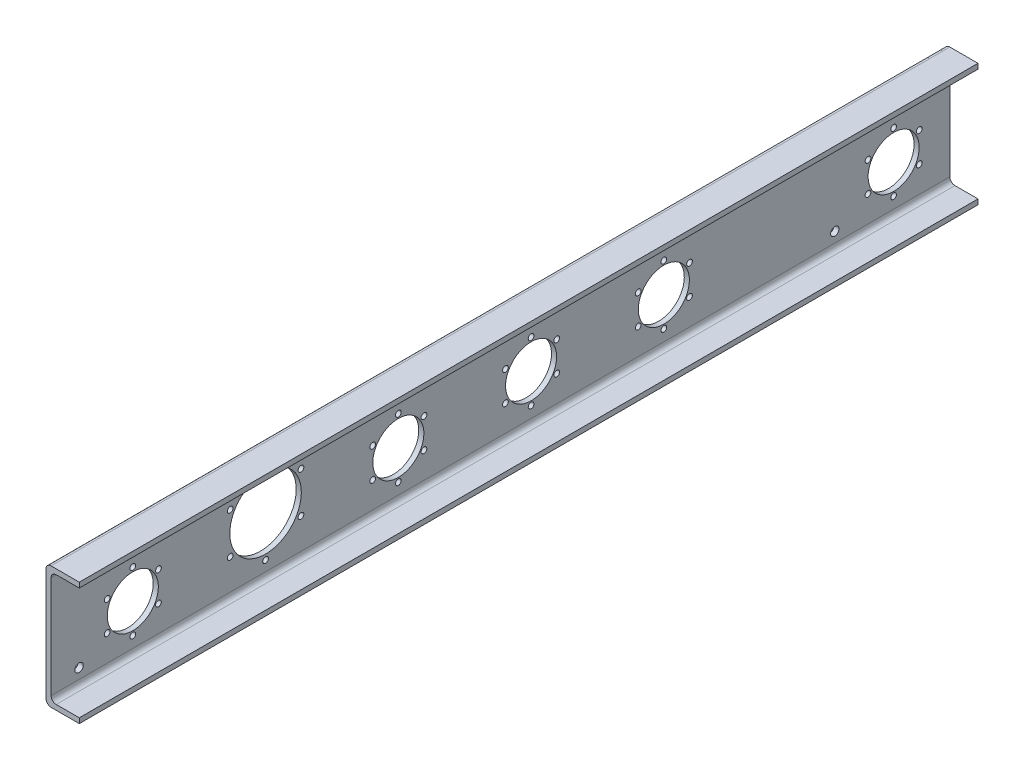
ISO-10303-21;
HEADER;
FILE_DESCRIPTION(('STEP AP214'),'2;1');
FILE_NAME('part.step','',(''),(''),'','','');
FILE_SCHEMA(('AUTOMOTIVE_DESIGN { 1 0 10303 214 1 1 1 1 }'));
ENDSEC;
DATA;
#1=APPLICATION_CONTEXT('core data for automotive mechanical design processes');
#2=APPLICATION_PROTOCOL_DEFINITION('international standard','automotive_design',2000,#1);
#3=PRODUCT_CONTEXT('',#1,'mechanical');
#4=PRODUCT('Part','Part','',(#3));
#5=PRODUCT_RELATED_PRODUCT_CATEGORY('part','',(#4));
#6=PRODUCT_DEFINITION_FORMATION('','',#4);
#7=PRODUCT_DEFINITION_CONTEXT('part definition',#1,'design');
#8=PRODUCT_DEFINITION('design','',#6,#7);
#9=PRODUCT_DEFINITION_SHAPE('','',#8);
#10=(LENGTH_UNIT() NAMED_UNIT(*) SI_UNIT(.MILLI.,.METRE.));
#11=(NAMED_UNIT(*) PLANE_ANGLE_UNIT() SI_UNIT($,.RADIAN.));
#12=(NAMED_UNIT(*) SI_UNIT($,.STERADIAN.) SOLID_ANGLE_UNIT());
#13=UNCERTAINTY_MEASURE_WITH_UNIT(LENGTH_MEASURE(1.E-05),#10,'distance_accuracy_value','');
#14=(GEOMETRIC_REPRESENTATION_CONTEXT(3) GLOBAL_UNCERTAINTY_ASSIGNED_CONTEXT((#13)) GLOBAL_UNIT_ASSIGNED_CONTEXT((#10,
#11,#12)) REPRESENTATION_CONTEXT('',''));
#15=CARTESIAN_POINT('',(0.,0.,0.));
#16=DIRECTION('',(0.,0.,1.));
#17=DIRECTION('',(1.,0.,0.));
#18=AXIS2_PLACEMENT_3D('',#15,#16,#17);
#19=CARTESIAN_POINT('',(0.,0.,1117.6));
#20=DIRECTION('',(0.,1.,0.));
#21=DIRECTION('',(0.,0.,1.));
#22=AXIS2_PLACEMENT_3D('',#19,#20,#21);
#23=PLANE('',#22);
#24=DIRECTION('',(1.,0.,0.));
#25=VECTOR('',#24,1.);
#26=CARTESIAN_POINT('',(0.,0.,1117.6));
#27=LINE('',#26,#25);
#28=CARTESIAN_POINT('',(6.35,0.,1117.6));
#29=VERTEX_POINT('',#28);
#30=CARTESIAN_POINT('',(41.402,0.,1117.6));
#31=VERTEX_POINT('',#30);
#32=EDGE_CURVE('E159',#29,#31,#27,.T.);
#33=ORIENTED_EDGE('',*,*,#32,.F.);
#34=DIRECTION('',(0.,0.,-1.));
#35=VECTOR('',#34,1.);
#36=CARTESIAN_POINT('',(6.35,0.,1117.6));
#37=LINE('',#36,#35);
#38=CARTESIAN_POINT('',(6.35,0.,0.));
#39=VERTEX_POINT('',#38);
#40=EDGE_CURVE('E123',#29,#39,#37,.T.);
#41=ORIENTED_EDGE('',*,*,#40,.T.);
#42=DIRECTION('',(1.,0.,0.));
#43=VECTOR('',#42,1.);
#44=CARTESIAN_POINT('',(0.,0.,0.));
#45=LINE('',#44,#43);
#46=CARTESIAN_POINT('',(41.402,0.,0.));
#47=VERTEX_POINT('',#46);
#48=EDGE_CURVE('E117',#39,#47,#45,.T.);
#49=ORIENTED_EDGE('',*,*,#48,.T.);
#50=DIRECTION('',(0.,0.,-1.));
#51=VECTOR('',#50,1.);
#52=CARTESIAN_POINT('',(41.402,0.,1117.6));
#53=LINE('',#52,#51);
#54=EDGE_CURVE('E120',#31,#47,#53,.T.);
#55=ORIENTED_EDGE('',*,*,#54,.F.);
#56=EDGE_LOOP('',(#33,#41,#49,#55));
#57=FACE_BOUND('',#56,.T.);
#58=ADVANCED_FACE('F26',(#57),#23,.F.);
#59=CARTESIAN_POINT('',(41.402,6.35,1117.6));
#60=DIRECTION('',(1.,0.,0.));
#61=DIRECTION('',(0.,0.,-1.));
#62=AXIS2_PLACEMENT_3D('',#59,#60,#61);
#63=PLANE('',#62);
#64=DIRECTION('',(0.,-1.,0.));
#65=VECTOR('',#64,1.);
#66=CARTESIAN_POINT('',(41.402,6.35,0.));
#67=LINE('',#66,#65);
#68=CARTESIAN_POINT('',(41.402,6.35,0.));
#69=VERTEX_POINT('',#68);
#70=EDGE_CURVE('E126',#69,#47,#67,.T.);
#71=ORIENTED_EDGE('',*,*,#70,.F.);
#72=DIRECTION('',(0.,0.,-1.));
#73=VECTOR('',#72,1.);
#74=CARTESIAN_POINT('',(41.402,6.35,1117.6));
#75=LINE('',#74,#73);
#76=CARTESIAN_POINT('',(41.402,6.35,1117.6));
#77=VERTEX_POINT('',#76);
#78=EDGE_CURVE('E136',#77,#69,#75,.T.);
#79=ORIENTED_EDGE('',*,*,#78,.F.);
#80=DIRECTION('',(0.,-1.,0.));
#81=VECTOR('',#80,1.);
#82=CARTESIAN_POINT('',(41.402,6.35,1117.6));
#83=LINE('',#82,#81);
#84=EDGE_CURVE('E134',#77,#31,#83,.T.);
#85=ORIENTED_EDGE('',*,*,#84,.T.);
#86=ORIENTED_EDGE('',*,*,#54,.T.);
#87=EDGE_LOOP('',(#71,#79,#85,#86));
#88=FACE_BOUND('',#87,.T.);
#89=ADVANCED_FACE('F131',(#88),#63,.T.);
#90=CARTESIAN_POINT('',(0.,6.35,1117.6));
#91=DIRECTION('',(0.,1.,0.));
#92=DIRECTION('',(0.,0.,1.));
#93=AXIS2_PLACEMENT_3D('',#90,#91,#92);
#94=PLANE('',#93);
#95=DIRECTION('',(1.,0.,0.));
#96=VECTOR('',#95,1.);
#97=CARTESIAN_POINT('',(0.,6.35,0.));
#98=LINE('',#97,#96);
#99=CARTESIAN_POINT('',(12.7,6.35,0.));
#100=VERTEX_POINT('',#99);
#101=EDGE_CURVE('E140',#100,#69,#98,.T.);
#102=ORIENTED_EDGE('',*,*,#101,.F.);
#103=DIRECTION('',(0.,0.,-1.));
#104=VECTOR('',#103,1.);
#105=CARTESIAN_POINT('',(12.7,6.35,1117.6));
#106=LINE('',#105,#104);
#107=CARTESIAN_POINT('',(12.7,6.35,1117.6));
#108=VERTEX_POINT('',#107);
#109=EDGE_CURVE('E189',#100,#108,#106,.F.);
#110=ORIENTED_EDGE('',*,*,#109,.T.);
#111=DIRECTION('',(1.,0.,0.));
#112=VECTOR('',#111,1.);
#113=CARTESIAN_POINT('',(0.,6.35,1117.6));
#114=LINE('',#113,#112);
#115=EDGE_CURVE('E162',#108,#77,#114,.T.);
#116=ORIENTED_EDGE('',*,*,#115,.T.);
#117=ORIENTED_EDGE('',*,*,#78,.T.);
#118=EDGE_LOOP('',(#102,#110,#116,#117));
#119=FACE_BOUND('',#118,.T.);
#120=ADVANCED_FACE('F246',(#119),#94,.T.);
#121=CARTESIAN_POINT('',(6.34999999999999,152.4,1117.6));
#122=DIRECTION('',(1.,0.,0.));
#123=DIRECTION('',(0.,1.,0.));
#124=AXIS2_PLACEMENT_3D('',#121,#122,#123);
#125=PLANE('',#124);
#126=CARTESIAN_POINT('',(6.34999999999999,81.9150000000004,37.9542843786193));
#127=DIRECTION('',(1.,0.,0.));
#128=DIRECTION('',(0.,0.50000000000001,-0.866025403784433));
#129=AXIS2_PLACEMENT_3D('',#126,#127,#128);
#130=CIRCLE('',#129,3.556);
#131=CARTESIAN_POINT('',(6.34999999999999,83.6930000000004,34.8746980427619));
#132=VERTEX_POINT('',#131);
#133=EDGE_CURVE('E974',#132,#132,#130,.T.);
#134=ORIENTED_EDGE('',*,*,#133,.F.);
#135=EDGE_LOOP('',(#134));
#136=FACE_BOUND('',#135,.T.);
#137=CARTESIAN_POINT('',(6.35,45.0850000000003,37.9542843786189));
#138=DIRECTION('',(1.,0.,0.));
#139=DIRECTION('',(0.,-0.499999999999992,-0.866025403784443));
#140=AXIS2_PLACEMENT_3D('',#137,#138,#139);
#141=CIRCLE('',#140,3.556);
#142=CARTESIAN_POINT('',(6.35,43.3070000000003,34.8746980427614));
#143=VERTEX_POINT('',#142);
#144=EDGE_CURVE('E968',#143,#143,#141,.T.);
#145=ORIENTED_EDGE('',*,*,#144,.F.);
#146=EDGE_LOOP('',(#145));
#147=FACE_BOUND('',#146,.T.);
#148=CARTESIAN_POINT('',(6.35,26.67,69.8499999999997));
#149=DIRECTION('',(1.,0.,0.));
#150=DIRECTION('',(0.,-1.,0.));
#151=AXIS2_PLACEMENT_3D('',#148,#149,#150);
#152=CIRCLE('',#151,3.556);
#153=CARTESIAN_POINT('',(6.35,23.114,69.8499999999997));
#154=VERTEX_POINT('',#153);
#155=EDGE_CURVE('E962',#154,#154,#152,.T.);
#156=ORIENTED_EDGE('',*,*,#155,.F.);
#157=EDGE_LOOP('',(#156));
#158=FACE_BOUND('',#157,.T.);
#159=CARTESIAN_POINT('',(6.35,45.0849999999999,101.745715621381));
#160=DIRECTION('',(1.,0.,0.));
#161=DIRECTION('',(0.,-0.500000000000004,0.866025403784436));
#162=AXIS2_PLACEMENT_3D('',#159,#160,#161);
#163=CIRCLE('',#162,3.556);
#164=CARTESIAN_POINT('',(6.35,43.3069999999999,104.825301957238));
#165=VERTEX_POINT('',#164);
#166=EDGE_CURVE('E956',#165,#165,#163,.T.);
#167=ORIENTED_EDGE('',*,*,#166,.F.);
#168=EDGE_LOOP('',(#167));
#169=FACE_BOUND('',#168,.T.);
#170=CARTESIAN_POINT('',(6.34999999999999,81.9149999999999,101.745715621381));
#171=DIRECTION('',(1.,0.,0.));
#172=DIRECTION('',(0.,0.499999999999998,0.86602540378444));
#173=AXIS2_PLACEMENT_3D('',#170,#171,#172);
#174=CIRCLE('',#173,3.556);
#175=CARTESIAN_POINT('',(6.34999999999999,83.6929999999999,104.825301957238));
#176=VERTEX_POINT('',#175);
#177=EDGE_CURVE('E950',#176,#176,#174,.T.);
#178=ORIENTED_EDGE('',*,*,#177,.F.);
#179=EDGE_LOOP('',(#178));
#180=FACE_BOUND('',#179,.T.);
#181=CARTESIAN_POINT('',(6.34999999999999,100.33,69.85));
#182=DIRECTION('',(1.,0.,0.));
#183=DIRECTION('',(0.,1.,0.));
#184=AXIS2_PLACEMENT_3D('',#181,#182,#183);
#185=CIRCLE('',#184,3.556);
#186=CARTESIAN_POINT('',(6.34999999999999,103.886,69.85));
#187=VERTEX_POINT('',#186);
#188=EDGE_CURVE('E947',#187,#187,#185,.T.);
#189=ORIENTED_EDGE('',*,*,#188,.F.);
#190=EDGE_LOOP('',(#189));
#191=FACE_BOUND('',#190,.T.);
#192=CARTESIAN_POINT('',(6.34999999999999,81.9150000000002,323.704284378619));
#193=DIRECTION('',(1.,0.,0.));
#194=DIRECTION('',(0.,0.50000000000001,-0.866025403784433));
#195=AXIS2_PLACEMENT_3D('',#192,#193,#194);
#196=CIRCLE('',#195,3.55599999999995);
#197=CARTESIAN_POINT('',(6.34999999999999,83.6930000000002,320.624698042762));
#198=VERTEX_POINT('',#197);
#199=EDGE_CURVE('E938',#198,#198,#196,.T.);
#200=ORIENTED_EDGE('',*,*,#199,.F.);
#201=EDGE_LOOP('',(#200));
#202=FACE_BOUND('',#201,.T.);
#203=CARTESIAN_POINT('',(6.35,45.085,323.704284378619));
#204=DIRECTION('',(1.,0.,0.));
#205=DIRECTION('',(0.,-0.499999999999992,-0.866025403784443));
#206=AXIS2_PLACEMENT_3D('',#203,#204,#205);
#207=CIRCLE('',#206,3.55599999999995);
#208=CARTESIAN_POINT('',(6.35,43.3070000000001,320.624698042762));
#209=VERTEX_POINT('',#208);
#210=EDGE_CURVE('E932',#209,#209,#207,.T.);
#211=ORIENTED_EDGE('',*,*,#210,.F.);
#212=EDGE_LOOP('',(#211));
#213=FACE_BOUND('',#212,.T.);
#214=CARTESIAN_POINT('',(6.35,26.67,355.6));
#215=DIRECTION('',(1.,0.,0.));
#216=DIRECTION('',(0.,-1.,0.));
#217=AXIS2_PLACEMENT_3D('',#214,#215,#216);
#218=CIRCLE('',#217,3.55599999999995);
#219=CARTESIAN_POINT('',(6.35,23.1140000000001,355.6));
#220=VERTEX_POINT('',#219);
#221=EDGE_CURVE('E926',#220,#220,#218,.T.);
#222=ORIENTED_EDGE('',*,*,#221,.F.);
#223=EDGE_LOOP('',(#222));
#224=FACE_BOUND('',#223,.T.);
#225=CARTESIAN_POINT('',(6.34999999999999,45.085,387.495715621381));
#226=DIRECTION('',(1.,0.,0.));
#227=DIRECTION('',(0.,-0.500000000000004,0.866025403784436));
#228=AXIS2_PLACEMENT_3D('',#225,#226,#227);
#229=CIRCLE('',#228,3.55599999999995);
#230=CARTESIAN_POINT('',(6.34999999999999,43.3070000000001,390.575301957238));
#231=VERTEX_POINT('',#230);
#232=EDGE_CURVE('E920',#231,#231,#229,.T.);
#233=ORIENTED_EDGE('',*,*,#232,.F.);
#234=EDGE_LOOP('',(#233));
#235=FACE_BOUND('',#234,.T.);
#236=CARTESIAN_POINT('',(6.34999999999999,81.9150000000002,387.495715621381));
#237=DIRECTION('',(1.,0.,0.));
#238=DIRECTION('',(0.,0.499999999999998,0.86602540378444));
#239=AXIS2_PLACEMENT_3D('',#236,#237,#238);
#240=CIRCLE('',#239,3.55599999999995);
#241=CARTESIAN_POINT('',(6.34999999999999,83.6930000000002,390.575301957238));
#242=VERTEX_POINT('',#241);
#243=EDGE_CURVE('E914',#242,#242,#240,.T.);
#244=ORIENTED_EDGE('',*,*,#243,.F.);
#245=EDGE_LOOP('',(#244));
#246=FACE_BOUND('',#245,.T.);
#247=CARTESIAN_POINT('',(6.34999999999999,100.33,355.6));
#248=DIRECTION('',(1.,0.,0.));
#249=DIRECTION('',(0.,1.,0.));
#250=AXIS2_PLACEMENT_3D('',#247,#248,#249);
#251=CIRCLE('',#250,3.55599999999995);
#252=CARTESIAN_POINT('',(6.34999999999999,103.886,355.6));
#253=VERTEX_POINT('',#252);
#254=EDGE_CURVE('E908',#253,#253,#251,.T.);
#255=ORIENTED_EDGE('',*,*,#254,.F.);
#256=EDGE_LOOP('',(#255));
#257=FACE_BOUND('',#256,.T.);
#258=CARTESIAN_POINT('',(6.34999999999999,81.9150000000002,488.804284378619));
#259=DIRECTION('',(1.,0.,0.));
#260=DIRECTION('',(0.,0.50000000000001,-0.866025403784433));
#261=AXIS2_PLACEMENT_3D('',#258,#259,#260);
#262=CIRCLE('',#261,3.55599999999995);
#263=CARTESIAN_POINT('',(6.34999999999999,83.6930000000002,485.724698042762));
#264=VERTEX_POINT('',#263);
#265=EDGE_CURVE('E902',#264,#264,#262,.T.);
#266=ORIENTED_EDGE('',*,*,#265,.F.);
#267=EDGE_LOOP('',(#266));
#268=FACE_BOUND('',#267,.T.);
#269=CARTESIAN_POINT('',(6.35,45.085,488.804284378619));
#270=DIRECTION('',(1.,0.,0.));
#271=DIRECTION('',(0.,-0.499999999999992,-0.866025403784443));
#272=AXIS2_PLACEMENT_3D('',#269,#270,#271);
#273=CIRCLE('',#272,3.55599999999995);
#274=CARTESIAN_POINT('',(6.35,43.3070000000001,485.724698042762));
#275=VERTEX_POINT('',#274);
#276=EDGE_CURVE('E896',#275,#275,#273,.T.);
#277=ORIENTED_EDGE('',*,*,#276,.F.);
#278=EDGE_LOOP('',(#277));
#279=FACE_BOUND('',#278,.T.);
#280=CARTESIAN_POINT('',(6.35,26.67,520.7));
#281=DIRECTION('',(1.,0.,0.));
#282=DIRECTION('',(0.,-1.,0.));
#283=AXIS2_PLACEMENT_3D('',#280,#281,#282);
#284=CIRCLE('',#283,3.55599999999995);
#285=CARTESIAN_POINT('',(6.35,23.1140000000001,520.7));
#286=VERTEX_POINT('',#285);
#287=EDGE_CURVE('E890',#286,#286,#284,.T.);
#288=ORIENTED_EDGE('',*,*,#287,.F.);
#289=EDGE_LOOP('',(#288));
#290=FACE_BOUND('',#289,.T.);
#291=CARTESIAN_POINT('',(6.34999999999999,45.085,552.595715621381));
#292=DIRECTION('',(1.,0.,0.));
#293=DIRECTION('',(0.,-0.500000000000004,0.866025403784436));
#294=AXIS2_PLACEMENT_3D('',#291,#292,#293);
#295=CIRCLE('',#294,3.55599999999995);
#296=CARTESIAN_POINT('',(6.34999999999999,43.3070000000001,555.675301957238));
#297=VERTEX_POINT('',#296);
#298=EDGE_CURVE('E884',#297,#297,#295,.T.);
#299=ORIENTED_EDGE('',*,*,#298,.F.);
#300=EDGE_LOOP('',(#299));
#301=FACE_BOUND('',#300,.T.);
#302=CARTESIAN_POINT('',(6.34999999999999,81.9150000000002,552.595715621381));
#303=DIRECTION('',(1.,0.,0.));
#304=DIRECTION('',(0.,0.499999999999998,0.86602540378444));
#305=AXIS2_PLACEMENT_3D('',#302,#303,#304);
#306=CIRCLE('',#305,3.55599999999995);
#307=CARTESIAN_POINT('',(6.34999999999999,83.6930000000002,555.675301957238));
#308=VERTEX_POINT('',#307);
#309=EDGE_CURVE('E878',#308,#308,#306,.T.);
#310=ORIENTED_EDGE('',*,*,#309,.F.);
#311=EDGE_LOOP('',(#310));
#312=FACE_BOUND('',#311,.T.);
#313=CARTESIAN_POINT('',(6.34999999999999,100.33,520.7));
#314=DIRECTION('',(1.,0.,0.));
#315=DIRECTION('',(0.,1.,0.));
#316=AXIS2_PLACEMENT_3D('',#313,#314,#315);
#317=CIRCLE('',#316,3.55599999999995);
#318=CARTESIAN_POINT('',(6.34999999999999,103.886,520.7));
#319=VERTEX_POINT('',#318);
#320=EDGE_CURVE('E872',#319,#319,#317,.T.);
#321=ORIENTED_EDGE('',*,*,#320,.F.);
#322=EDGE_LOOP('',(#321));
#323=FACE_BOUND('',#322,.T.);
#324=CARTESIAN_POINT('',(6.34999999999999,81.9150000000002,653.904284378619));
#325=DIRECTION('',(1.,0.,0.));
#326=DIRECTION('',(0.,0.50000000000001,-0.866025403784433));
#327=AXIS2_PLACEMENT_3D('',#324,#325,#326);
#328=CIRCLE('',#327,3.55599999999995);
#329=CARTESIAN_POINT('',(6.34999999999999,83.6930000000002,650.824698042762));
#330=VERTEX_POINT('',#329);
#331=EDGE_CURVE('E866',#330,#330,#328,.T.);
#332=ORIENTED_EDGE('',*,*,#331,.F.);
#333=EDGE_LOOP('',(#332));
#334=FACE_BOUND('',#333,.T.);
#335=CARTESIAN_POINT('',(6.35,45.085,653.904284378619));
#336=DIRECTION('',(1.,0.,0.));
#337=DIRECTION('',(0.,-0.499999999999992,-0.866025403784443));
#338=AXIS2_PLACEMENT_3D('',#335,#336,#337);
#339=CIRCLE('',#338,3.55599999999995);
#340=CARTESIAN_POINT('',(6.35,43.3070000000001,650.824698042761));
#341=VERTEX_POINT('',#340);
#342=EDGE_CURVE('E860',#341,#341,#339,.T.);
#343=ORIENTED_EDGE('',*,*,#342,.F.);
#344=EDGE_LOOP('',(#343));
#345=FACE_BOUND('',#344,.T.);
#346=CARTESIAN_POINT('',(6.35,26.67,685.8));
#347=DIRECTION('',(1.,0.,0.));
#348=DIRECTION('',(0.,-1.,0.));
#349=AXIS2_PLACEMENT_3D('',#346,#347,#348);
#350=CIRCLE('',#349,3.55599999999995);
#351=CARTESIAN_POINT('',(6.35,23.1140000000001,685.8));
#352=VERTEX_POINT('',#351);
#353=EDGE_CURVE('E854',#352,#352,#350,.T.);
#354=ORIENTED_EDGE('',*,*,#353,.F.);
#355=EDGE_LOOP('',(#354));
#356=FACE_BOUND('',#355,.T.);
#357=CARTESIAN_POINT('',(6.34999999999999,45.085,717.695715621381));
#358=DIRECTION('',(1.,0.,0.));
#359=DIRECTION('',(0.,-0.500000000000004,0.866025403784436));
#360=AXIS2_PLACEMENT_3D('',#357,#358,#359);
#361=CIRCLE('',#360,3.55599999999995);
#362=CARTESIAN_POINT('',(6.34999999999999,43.3070000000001,720.775301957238));
#363=VERTEX_POINT('',#362);
#364=EDGE_CURVE('E848',#363,#363,#361,.T.);
#365=ORIENTED_EDGE('',*,*,#364,.F.);
#366=EDGE_LOOP('',(#365));
#367=FACE_BOUND('',#366,.T.);
#368=CARTESIAN_POINT('',(6.34999999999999,81.9150000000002,717.695715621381));
#369=DIRECTION('',(1.,0.,0.));
#370=DIRECTION('',(0.,0.499999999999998,0.86602540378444));
#371=AXIS2_PLACEMENT_3D('',#368,#369,#370);
#372=CIRCLE('',#371,3.55599999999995);
#373=CARTESIAN_POINT('',(6.34999999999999,83.6930000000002,720.775301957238));
#374=VERTEX_POINT('',#373);
#375=EDGE_CURVE('E842',#374,#374,#372,.T.);
#376=ORIENTED_EDGE('',*,*,#375,.F.);
#377=EDGE_LOOP('',(#376));
#378=FACE_BOUND('',#377,.T.);
#379=CARTESIAN_POINT('',(6.34999999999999,100.33,685.8));
#380=DIRECTION('',(1.,0.,0.));
#381=DIRECTION('',(0.,1.,0.));
#382=AXIS2_PLACEMENT_3D('',#379,#380,#381);
#383=CIRCLE('',#382,3.55599999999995);
#384=CARTESIAN_POINT('',(6.34999999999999,103.886,685.8));
#385=VERTEX_POINT('',#384);
#386=EDGE_CURVE('E836',#385,#385,#383,.T.);
#387=ORIENTED_EDGE('',*,*,#386,.F.);
#388=EDGE_LOOP('',(#387));
#389=FACE_BOUND('',#388,.T.);
#390=CARTESIAN_POINT('',(6.34999999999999,81.9150000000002,984.104284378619));
#391=DIRECTION('',(1.,0.,0.));
#392=DIRECTION('',(0.,0.50000000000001,-0.866025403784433));
#393=AXIS2_PLACEMENT_3D('',#390,#391,#392);
#394=CIRCLE('',#393,3.55599999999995);
#395=CARTESIAN_POINT('',(6.34999999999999,83.6930000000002,981.024698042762));
#396=VERTEX_POINT('',#395);
#397=EDGE_CURVE('E830',#396,#396,#394,.T.);
#398=ORIENTED_EDGE('',*,*,#397,.F.);
#399=EDGE_LOOP('',(#398));
#400=FACE_BOUND('',#399,.T.);
#401=CARTESIAN_POINT('',(6.35,45.085,984.104284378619));
#402=DIRECTION('',(1.,0.,0.));
#403=DIRECTION('',(0.,-0.499999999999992,-0.866025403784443));
#404=AXIS2_PLACEMENT_3D('',#401,#402,#403);
#405=CIRCLE('',#404,3.55599999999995);
#406=CARTESIAN_POINT('',(6.35,43.3070000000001,981.024698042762));
#407=VERTEX_POINT('',#406);
#408=EDGE_CURVE('E824',#407,#407,#405,.T.);
#409=ORIENTED_EDGE('',*,*,#408,.F.);
#410=EDGE_LOOP('',(#409));
#411=FACE_BOUND('',#410,.T.);
#412=CARTESIAN_POINT('',(6.35,26.67,1016.));
#413=DIRECTION('',(1.,0.,0.));
#414=DIRECTION('',(0.,-1.,0.));
#415=AXIS2_PLACEMENT_3D('',#412,#413,#414);
#416=CIRCLE('',#415,3.55599999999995);
#417=CARTESIAN_POINT('',(6.35,23.1140000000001,1016.));
#418=VERTEX_POINT('',#417);
#419=EDGE_CURVE('E818',#418,#418,#416,.T.);
#420=ORIENTED_EDGE('',*,*,#419,.F.);
#421=EDGE_LOOP('',(#420));
#422=FACE_BOUND('',#421,.T.);
#423=CARTESIAN_POINT('',(6.34999999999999,45.085,1047.89571562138));
#424=DIRECTION('',(1.,0.,0.));
#425=DIRECTION('',(0.,-0.500000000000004,0.866025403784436));
#426=AXIS2_PLACEMENT_3D('',#423,#424,#425);
#427=CIRCLE('',#426,3.55599999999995);
#428=CARTESIAN_POINT('',(6.34999999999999,43.3070000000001,1050.97530195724));
#429=VERTEX_POINT('',#428);
#430=EDGE_CURVE('E812',#429,#429,#427,.T.);
#431=ORIENTED_EDGE('',*,*,#430,.F.);
#432=EDGE_LOOP('',(#431));
#433=FACE_BOUND('',#432,.T.);
#434=CARTESIAN_POINT('',(6.34999999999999,81.9150000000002,1047.89571562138));
#435=DIRECTION('',(1.,0.,0.));
#436=DIRECTION('',(0.,0.499999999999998,0.86602540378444));
#437=AXIS2_PLACEMENT_3D('',#434,#435,#436);
#438=CIRCLE('',#437,3.55599999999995);
#439=CARTESIAN_POINT('',(6.34999999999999,83.6930000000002,1050.97530195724));
#440=VERTEX_POINT('',#439);
#441=EDGE_CURVE('E806',#440,#440,#438,.T.);
#442=ORIENTED_EDGE('',*,*,#441,.F.);
#443=EDGE_LOOP('',(#442));
#444=FACE_BOUND('',#443,.T.);
#445=CARTESIAN_POINT('',(6.34999999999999,100.33,1016.));
#446=DIRECTION('',(1.,0.,0.));
#447=DIRECTION('',(0.,1.,0.));
#448=AXIS2_PLACEMENT_3D('',#445,#446,#447);
#449=CIRCLE('',#448,3.55599999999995);
#450=CARTESIAN_POINT('',(6.34999999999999,103.886,1016.));
#451=VERTEX_POINT('',#450);
#452=EDGE_CURVE('E803',#451,#451,#449,.T.);
#453=ORIENTED_EDGE('',*,*,#452,.F.);
#454=EDGE_LOOP('',(#453));
#455=FACE_BOUND('',#454,.T.);
#456=CARTESIAN_POINT('',(6.34999999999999,101.6,806.905909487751));
#457=DIRECTION('',(1.,0.,0.));
#458=DIRECTION('',(0.,0.50000000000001,-0.866025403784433));
#459=AXIS2_PLACEMENT_3D('',#456,#457,#458);
#460=CIRCLE('',#459,3.55599999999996);
#461=CARTESIAN_POINT('',(6.34999999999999,103.378,803.826323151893));
#462=VERTEX_POINT('',#461);
#463=EDGE_CURVE('E794',#462,#462,#460,.T.);
#464=ORIENTED_EDGE('',*,*,#463,.F.);
#465=EDGE_LOOP('',(#464));
#466=FACE_BOUND('',#465,.T.);
#467=CARTESIAN_POINT('',(6.34999999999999,50.8000000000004,806.90590948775));
#468=DIRECTION('',(1.,0.,0.));
#469=DIRECTION('',(0.,-0.499999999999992,-0.866025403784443));
#470=AXIS2_PLACEMENT_3D('',#467,#468,#469);
#471=CIRCLE('',#470,3.55599999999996);
#472=CARTESIAN_POINT('',(6.34999999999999,49.0220000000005,803.826323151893));
#473=VERTEX_POINT('',#472);
#474=EDGE_CURVE('E788',#473,#473,#471,.T.);
#475=ORIENTED_EDGE('',*,*,#474,.F.);
#476=EDGE_LOOP('',(#475));
#477=FACE_BOUND('',#476,.T.);
#478=CARTESIAN_POINT('',(6.35,25.4,850.9));
#479=DIRECTION('',(1.,0.,0.));
#480=DIRECTION('',(0.,-1.,0.));
#481=AXIS2_PLACEMENT_3D('',#478,#479,#480);
#482=CIRCLE('',#481,3.55599999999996);
#483=CARTESIAN_POINT('',(6.35,21.8440000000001,850.9));
#484=VERTEX_POINT('',#483);
#485=EDGE_CURVE('E782',#484,#484,#482,.T.);
#486=ORIENTED_EDGE('',*,*,#485,.F.);
#487=EDGE_LOOP('',(#486));
#488=FACE_BOUND('',#487,.T.);
#489=CARTESIAN_POINT('',(6.34999999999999,50.7999999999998,894.894090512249));
#490=DIRECTION('',(1.,0.,0.));
#491=DIRECTION('',(0.,-0.500000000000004,0.866025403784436));
#492=AXIS2_PLACEMENT_3D('',#489,#490,#491);
#493=CIRCLE('',#492,3.55599999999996);
#494=CARTESIAN_POINT('',(6.34999999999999,49.0219999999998,897.973676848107));
#495=VERTEX_POINT('',#494);
#496=EDGE_CURVE('E776',#495,#495,#493,.T.);
#497=ORIENTED_EDGE('',*,*,#496,.F.);
#498=EDGE_LOOP('',(#497));
#499=FACE_BOUND('',#498,.T.);
#500=CARTESIAN_POINT('',(6.34999999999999,101.6,894.89409051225));
#501=DIRECTION('',(1.,0.,0.));
#502=DIRECTION('',(0.,0.499999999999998,0.86602540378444));
#503=AXIS2_PLACEMENT_3D('',#500,#501,#502);
#504=CIRCLE('',#503,3.55599999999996);
#505=CARTESIAN_POINT('',(6.34999999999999,103.378,897.973676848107));
#506=VERTEX_POINT('',#505);
#507=EDGE_CURVE('E770',#506,#506,#504,.T.);
#508=ORIENTED_EDGE('',*,*,#507,.F.);
#509=EDGE_LOOP('',(#508));
#510=FACE_BOUND('',#509,.T.);
#511=CARTESIAN_POINT('',(6.34999999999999,127.,850.9));
#512=DIRECTION('',(1.,0.,0.));
#513=DIRECTION('',(0.,1.,0.));
#514=AXIS2_PLACEMENT_3D('',#511,#512,#513);
#515=CIRCLE('',#514,3.55599999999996);
#516=CARTESIAN_POINT('',(6.34999999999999,130.556,850.9));
#517=VERTEX_POINT('',#516);
#518=EDGE_CURVE('E767',#517,#517,#515,.T.);
#519=ORIENTED_EDGE('',*,*,#518,.F.);
#520=EDGE_LOOP('',(#519));
#521=FACE_BOUND('',#520,.T.);
#522=CARTESIAN_POINT('',(6.34999999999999,127.,143.002));
#523=DIRECTION('',(1.,0.,0.));
#524=DIRECTION('',(0.,1.,0.));
#525=AXIS2_PLACEMENT_3D('',#522,#523,#524);
#526=CIRCLE('',#525,5.20700000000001);
#527=CARTESIAN_POINT('',(6.34999999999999,132.207,143.002));
#528=VERTEX_POINT('',#527);
#529=EDGE_CURVE('E761',#528,#528,#526,.T.);
#530=ORIENTED_EDGE('',*,*,#529,.F.);
#531=EDGE_LOOP('',(#530));
#532=FACE_BOUND('',#531,.T.);
#533=CARTESIAN_POINT('',(6.35,25.4,143.002));
#534=DIRECTION('',(1.,0.,0.));
#535=DIRECTION('',(0.,1.,0.));
#536=AXIS2_PLACEMENT_3D('',#533,#534,#535);
#537=CIRCLE('',#536,5.20699999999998);
#538=CARTESIAN_POINT('',(6.35,30.607,143.002));
#539=VERTEX_POINT('',#538);
#540=EDGE_CURVE('E755',#539,#539,#537,.T.);
#541=ORIENTED_EDGE('',*,*,#540,.F.);
#542=EDGE_LOOP('',(#541));
#543=FACE_BOUND('',#542,.T.);
#544=CARTESIAN_POINT('',(6.35,25.4,1082.802));
#545=DIRECTION('',(1.,0.,0.));
#546=DIRECTION('',(0.,1.,0.));
#547=AXIS2_PLACEMENT_3D('',#544,#545,#546);
#548=CIRCLE('',#547,5.20699999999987);
#549=CARTESIAN_POINT('',(6.35,30.6069999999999,1082.802));
#550=VERTEX_POINT('',#549);
#551=EDGE_CURVE('E749',#550,#550,#548,.T.);
#552=ORIENTED_EDGE('',*,*,#551,.F.);
#553=EDGE_LOOP('',(#552));
#554=FACE_BOUND('',#553,.T.);
#555=CARTESIAN_POINT('',(6.34999999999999,127.,1082.802));
#556=DIRECTION('',(1.,0.,0.));
#557=DIRECTION('',(0.,1.,0.));
#558=AXIS2_PLACEMENT_3D('',#555,#556,#557);
#559=CIRCLE('',#558,5.20699999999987);
#560=CARTESIAN_POINT('',(6.34999999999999,132.207,1082.802));
#561=VERTEX_POINT('',#560);
#562=EDGE_CURVE('E743',#561,#561,#559,.T.);
#563=ORIENTED_EDGE('',*,*,#562,.F.);
#564=EDGE_LOOP('',(#563));
#565=FACE_BOUND('',#564,.T.);
#566=CARTESIAN_POINT('',(6.34999999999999,63.5,69.85));
#567=DIRECTION('',(1.,0.,0.));
#568=DIRECTION('',(0.,1.,0.));
#569=AXIS2_PLACEMENT_3D('',#566,#567,#568);
#570=CIRCLE('',#569,31.75);
#571=CARTESIAN_POINT('',(6.34999999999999,95.25,69.85));
#572=VERTEX_POINT('',#571);
#573=EDGE_CURVE('E737',#572,#572,#570,.T.);
#574=ORIENTED_EDGE('',*,*,#573,.F.);
#575=EDGE_LOOP('',(#574));
#576=FACE_BOUND('',#575,.T.);
#577=CARTESIAN_POINT('',(6.34999999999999,63.5,355.6));
#578=DIRECTION('',(1.,0.,0.));
#579=DIRECTION('',(0.,1.,0.));
#580=AXIS2_PLACEMENT_3D('',#577,#578,#579);
#581=CIRCLE('',#580,31.75);
#582=CARTESIAN_POINT('',(6.34999999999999,95.25,355.6));
#583=VERTEX_POINT('',#582);
#584=EDGE_CURVE('E731',#583,#583,#581,.T.);
#585=ORIENTED_EDGE('',*,*,#584,.F.);
#586=EDGE_LOOP('',(#585));
#587=FACE_BOUND('',#586,.T.);
#588=CARTESIAN_POINT('',(6.34999999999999,63.5,1016.));
#589=DIRECTION('',(1.,0.,0.));
#590=DIRECTION('',(0.,1.,0.));
#591=AXIS2_PLACEMENT_3D('',#588,#589,#590);
#592=CIRCLE('',#591,31.7499999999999);
#593=CARTESIAN_POINT('',(6.34999999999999,95.2499999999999,1016.));
#594=VERTEX_POINT('',#593);
#595=EDGE_CURVE('E725',#594,#594,#592,.T.);
#596=ORIENTED_EDGE('',*,*,#595,.F.);
#597=EDGE_LOOP('',(#596));
#598=FACE_BOUND('',#597,.T.);
#599=CARTESIAN_POINT('',(6.34999999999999,76.2,850.9));
#600=DIRECTION('',(1.,0.,0.));
#601=DIRECTION('',(0.,1.,0.));
#602=AXIS2_PLACEMENT_3D('',#599,#600,#601);
#603=CIRCLE('',#602,44.45);
#604=CARTESIAN_POINT('',(6.34999999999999,120.65,850.9));
#605=VERTEX_POINT('',#604);
#606=EDGE_CURVE('E719',#605,#605,#603,.T.);
#607=ORIENTED_EDGE('',*,*,#606,.F.);
#608=EDGE_LOOP('',(#607));
#609=FACE_BOUND('',#608,.T.);
#610=CARTESIAN_POINT('',(6.34999999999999,63.5,685.8));
#611=DIRECTION('',(1.,0.,0.));
#612=DIRECTION('',(0.,1.,0.));
#613=AXIS2_PLACEMENT_3D('',#610,#611,#612);
#614=CIRCLE('',#613,31.7499999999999);
#615=CARTESIAN_POINT('',(6.34999999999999,95.2499999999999,685.8));
#616=VERTEX_POINT('',#615);
#617=EDGE_CURVE('E711',#616,#616,#614,.T.);
#618=ORIENTED_EDGE('',*,*,#617,.F.);
#619=EDGE_LOOP('',(#618));
#620=FACE_BOUND('',#619,.T.);
#621=CARTESIAN_POINT('',(6.34999999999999,63.5,520.7));
#622=DIRECTION('',(1.,0.,0.));
#623=DIRECTION('',(0.,1.,0.));
#624=AXIS2_PLACEMENT_3D('',#621,#622,#623);
#625=CIRCLE('',#624,31.75);
#626=CARTESIAN_POINT('',(6.34999999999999,95.25,520.7));
#627=VERTEX_POINT('',#626);
#628=EDGE_CURVE('E706',#627,#627,#625,.T.);
#629=ORIENTED_EDGE('',*,*,#628,.F.);
#630=EDGE_LOOP('',(#629));
#631=FACE_BOUND('',#630,.T.);
#632=DIRECTION('',(0.,-1.,0.));
#633=VECTOR('',#632,1.);
#634=CARTESIAN_POINT('',(6.34999999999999,152.4,0.));
#635=LINE('',#634,#633);
#636=CARTESIAN_POINT('',(6.34999999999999,139.7,0.));
#637=VERTEX_POINT('',#636);
#638=CARTESIAN_POINT('',(6.35,12.7,0.));
#639=VERTEX_POINT('',#638);
#640=EDGE_CURVE('E143',#637,#639,#635,.T.);
#641=ORIENTED_EDGE('',*,*,#640,.F.);
#642=DIRECTION('',(0.,0.,-1.));
#643=VECTOR('',#642,1.);
#644=CARTESIAN_POINT('',(6.34999999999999,139.7,1117.6));
#645=LINE('',#644,#643);
#646=CARTESIAN_POINT('',(6.34999999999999,139.7,1117.6));
#647=VERTEX_POINT('',#646);
#648=EDGE_CURVE('E187',#637,#647,#645,.F.);
#649=ORIENTED_EDGE('',*,*,#648,.T.);
#650=DIRECTION('',(0.,-1.,0.));
#651=VECTOR('',#650,1.);
#652=CARTESIAN_POINT('',(6.34999999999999,152.4,1117.6));
#653=LINE('',#652,#651);
#654=CARTESIAN_POINT('',(6.35,12.7,1117.6));
#655=VERTEX_POINT('',#654);
#656=EDGE_CURVE('E164',#647,#655,#653,.T.);
#657=ORIENTED_EDGE('',*,*,#656,.T.);
#658=DIRECTION('',(0.,0.,-1.));
#659=VECTOR('',#658,1.);
#660=CARTESIAN_POINT('',(6.35,12.7,0.));
#661=LINE('',#660,#659);
#662=EDGE_CURVE('E184',#655,#639,#661,.T.);
#663=ORIENTED_EDGE('',*,*,#662,.T.);
#664=EDGE_LOOP('',(#641,#649,#657,#663));
#665=FACE_BOUND('',#664,.T.);
#666=ADVANCED_FACE('F238',(#136,#147,#158,#169,#180,#191,#202,#213,#224,#235,#246,#257,#268,
#279,#290,#301,#312,#323,#334,#345,#356,#367,#378,#389,#400,#411,#422,#433,#444,#455,#466,#477,
#488,#499,#510,#521,#532,#543,#554,#565,#576,#587,#598,#609,#620,#631,#665),#125,.T.);
#667=CARTESIAN_POINT('',(0.,146.05,1117.6));
#668=DIRECTION('',(0.,-1.,0.));
#669=DIRECTION('',(0.,0.,-1.));
#670=AXIS2_PLACEMENT_3D('',#667,#668,#669);
#671=PLANE('',#670);
#672=DIRECTION('',(1.,0.,0.));
#673=VECTOR('',#672,1.);
#674=CARTESIAN_POINT('',(0.,146.05,1117.6));
#675=LINE('',#674,#673);
#676=CARTESIAN_POINT('',(41.402,146.05,1117.6));
#677=VERTEX_POINT('',#676);
#678=CARTESIAN_POINT('',(12.7,146.05,1117.6));
#679=VERTEX_POINT('',#678);
#680=EDGE_CURVE('E167',#677,#679,#675,.F.);
#681=ORIENTED_EDGE('',*,*,#680,.T.);
#682=DIRECTION('',(0.,0.,-1.));
#683=VECTOR('',#682,1.);
#684=CARTESIAN_POINT('',(12.7,146.05,0.));
#685=LINE('',#684,#683);
#686=CARTESIAN_POINT('',(12.7,146.05,0.));
#687=VERTEX_POINT('',#686);
#688=EDGE_CURVE('E135',#679,#687,#685,.T.);
#689=ORIENTED_EDGE('',*,*,#688,.T.);
#690=DIRECTION('',(1.,0.,0.));
#691=VECTOR('',#690,1.);
#692=CARTESIAN_POINT('',(0.,146.05,0.));
#693=LINE('',#692,#691);
#694=CARTESIAN_POINT('',(41.402,146.05,0.));
#695=VERTEX_POINT('',#694);
#696=EDGE_CURVE('E149',#695,#687,#693,.F.);
#697=ORIENTED_EDGE('',*,*,#696,.F.);
#698=DIRECTION('',(0.,0.,-1.));
#699=VECTOR('',#698,1.);
#700=CARTESIAN_POINT('',(41.402,146.05,1117.6));
#701=LINE('',#700,#699);
#702=EDGE_CURVE('E179',#677,#695,#701,.T.);
#703=ORIENTED_EDGE('',*,*,#702,.F.);
#704=EDGE_LOOP('',(#681,#689,#697,#703));
#705=FACE_BOUND('',#704,.T.);
#706=ADVANCED_FACE('F229',(#705),#671,.T.);
#707=CARTESIAN_POINT('',(41.402,152.4,1117.6));
#708=DIRECTION('',(1.,0.,0.));
#709=DIRECTION('',(0.,0.,-1.));
#710=AXIS2_PLACEMENT_3D('',#707,#708,#709);
#711=PLANE('',#710);
#712=DIRECTION('',(0.,-1.,0.));
#713=VECTOR('',#712,1.);
#714=CARTESIAN_POINT('',(41.402,152.4,0.));
#715=LINE('',#714,#713);
#716=CARTESIAN_POINT('',(41.402,152.4,0.));
#717=VERTEX_POINT('',#716);
#718=EDGE_CURVE('E152',#717,#695,#715,.T.);
#719=ORIENTED_EDGE('',*,*,#718,.F.);
#720=DIRECTION('',(0.,0.,-1.));
#721=VECTOR('',#720,1.);
#722=CARTESIAN_POINT('',(41.402,152.4,1117.6));
#723=LINE('',#722,#721);
#724=CARTESIAN_POINT('',(41.402,152.4,1117.6));
#725=VERTEX_POINT('',#724);
#726=EDGE_CURVE('E177',#725,#717,#723,.T.);
#727=ORIENTED_EDGE('',*,*,#726,.F.);
#728=DIRECTION('',(0.,-1.,0.));
#729=VECTOR('',#728,1.);
#730=CARTESIAN_POINT('',(41.402,152.4,1117.6));
#731=LINE('',#730,#729);
#732=EDGE_CURVE('E170',#725,#677,#731,.T.);
#733=ORIENTED_EDGE('',*,*,#732,.T.);
#734=ORIENTED_EDGE('',*,*,#702,.T.);
#735=EDGE_LOOP('',(#719,#727,#733,#734));
#736=FACE_BOUND('',#735,.T.);
#737=ADVANCED_FACE('F225',(#736),#711,.T.);
#738=CARTESIAN_POINT('',(0.,152.4,1117.6));
#739=DIRECTION('',(0.,-1.,0.));
#740=DIRECTION('',(0.,0.,-1.));
#741=AXIS2_PLACEMENT_3D('',#738,#739,#740);
#742=PLANE('',#741);
#743=DIRECTION('',(-1.,0.,0.));
#744=VECTOR('',#743,1.);
#745=CARTESIAN_POINT('',(0.,152.4,0.));
#746=LINE('',#745,#744);
#747=CARTESIAN_POINT('',(6.34999999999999,152.4,0.));
#748=VERTEX_POINT('',#747);
#749=EDGE_CURVE('E155',#717,#748,#746,.T.);
#750=ORIENTED_EDGE('',*,*,#749,.T.);
#751=DIRECTION('',(0.,0.,-1.));
#752=VECTOR('',#751,1.);
#753=CARTESIAN_POINT('',(6.34999999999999,152.4,1117.6));
#754=LINE('',#753,#752);
#755=CARTESIAN_POINT('',(6.34999999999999,152.4,1117.6));
#756=VERTEX_POINT('',#755);
#757=EDGE_CURVE('E11',#748,#756,#754,.F.);
#758=ORIENTED_EDGE('',*,*,#757,.T.);
#759=DIRECTION('',(-1.,0.,0.));
#760=VECTOR('',#759,1.);
#761=CARTESIAN_POINT('',(0.,152.4,1117.6));
#762=LINE('',#761,#760);
#763=EDGE_CURVE('E173',#725,#756,#762,.T.);
#764=ORIENTED_EDGE('',*,*,#763,.F.);
#765=ORIENTED_EDGE('',*,*,#726,.T.);
#766=EDGE_LOOP('',(#750,#758,#764,#765));
#767=FACE_BOUND('',#766,.T.);
#768=ADVANCED_FACE('F222',(#767),#742,.F.);
#769=CARTESIAN_POINT('',(0.,152.4,1117.6));
#770=DIRECTION('',(1.,0.,0.));
#771=DIRECTION('',(0.,1.,0.));
#772=AXIS2_PLACEMENT_3D('',#769,#770,#771);
#773=PLANE('',#772);
#774=CARTESIAN_POINT('',(0.,81.9150000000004,37.9542843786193));
#775=DIRECTION('',(1.,0.,0.));
#776=DIRECTION('',(0.,0.50000000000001,-0.866025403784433));
#777=AXIS2_PLACEMENT_3D('',#774,#775,#776);
#778=CIRCLE('',#777,3.556);
#779=CARTESIAN_POINT('',(0.,83.6930000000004,34.8746980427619));
#780=VERTEX_POINT('',#779);
#781=EDGE_CURVE('E977',#780,#780,#778,.T.);
#782=ORIENTED_EDGE('',*,*,#781,.T.);
#783=EDGE_LOOP('',(#782));
#784=FACE_BOUND('',#783,.T.);
#785=CARTESIAN_POINT('',(0.,45.0850000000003,37.9542843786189));
#786=DIRECTION('',(1.,0.,0.));
#787=DIRECTION('',(0.,-0.499999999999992,-0.866025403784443));
#788=AXIS2_PLACEMENT_3D('',#785,#786,#787);
#789=CIRCLE('',#788,3.556);
#790=CARTESIAN_POINT('',(0.,43.3070000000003,34.8746980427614));
#791=VERTEX_POINT('',#790);
#792=EDGE_CURVE('E971',#791,#791,#789,.T.);
#793=ORIENTED_EDGE('',*,*,#792,.T.);
#794=EDGE_LOOP('',(#793));
#795=FACE_BOUND('',#794,.T.);
#796=CARTESIAN_POINT('',(0.,26.67,69.8499999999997));
#797=DIRECTION('',(1.,0.,0.));
#798=DIRECTION('',(0.,-1.,0.));
#799=AXIS2_PLACEMENT_3D('',#796,#797,#798);
#800=CIRCLE('',#799,3.556);
#801=CARTESIAN_POINT('',(0.,23.114,69.8499999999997));
#802=VERTEX_POINT('',#801);
#803=EDGE_CURVE('E965',#802,#802,#800,.T.);
#804=ORIENTED_EDGE('',*,*,#803,.T.);
#805=EDGE_LOOP('',(#804));
#806=FACE_BOUND('',#805,.T.);
#807=CARTESIAN_POINT('',(0.,45.0849999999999,101.745715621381));
#808=DIRECTION('',(1.,0.,0.));
#809=DIRECTION('',(0.,-0.500000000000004,0.866025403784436));
#810=AXIS2_PLACEMENT_3D('',#807,#808,#809);
#811=CIRCLE('',#810,3.556);
#812=CARTESIAN_POINT('',(0.,43.3069999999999,104.825301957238));
#813=VERTEX_POINT('',#812);
#814=EDGE_CURVE('E959',#813,#813,#811,.T.);
#815=ORIENTED_EDGE('',*,*,#814,.T.);
#816=EDGE_LOOP('',(#815));
#817=FACE_BOUND('',#816,.T.);
#818=CARTESIAN_POINT('',(0.,81.9149999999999,101.745715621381));
#819=DIRECTION('',(1.,0.,0.));
#820=DIRECTION('',(0.,0.499999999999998,0.86602540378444));
#821=AXIS2_PLACEMENT_3D('',#818,#819,#820);
#822=CIRCLE('',#821,3.556);
#823=CARTESIAN_POINT('',(0.,83.6929999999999,104.825301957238));
#824=VERTEX_POINT('',#823);
#825=EDGE_CURVE('E953',#824,#824,#822,.T.);
#826=ORIENTED_EDGE('',*,*,#825,.T.);
#827=EDGE_LOOP('',(#826));
#828=FACE_BOUND('',#827,.T.);
#829=CARTESIAN_POINT('',(0.,100.33,69.85));
#830=DIRECTION('',(1.,0.,0.));
#831=DIRECTION('',(0.,1.,0.));
#832=AXIS2_PLACEMENT_3D('',#829,#830,#831);
#833=CIRCLE('',#832,3.556);
#834=CARTESIAN_POINT('',(0.,103.886,69.85));
#835=VERTEX_POINT('',#834);
#836=EDGE_CURVE('E944',#835,#835,#833,.T.);
#837=ORIENTED_EDGE('',*,*,#836,.T.);
#838=EDGE_LOOP('',(#837));
#839=FACE_BOUND('',#838,.T.);
#840=CARTESIAN_POINT('',(0.,81.9150000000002,323.704284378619));
#841=DIRECTION('',(1.,0.,0.));
#842=DIRECTION('',(0.,0.50000000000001,-0.866025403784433));
#843=AXIS2_PLACEMENT_3D('',#840,#841,#842);
#844=CIRCLE('',#843,3.55599999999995);
#845=CARTESIAN_POINT('',(0.,83.6930000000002,320.624698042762));
#846=VERTEX_POINT('',#845);
#847=EDGE_CURVE('E941',#846,#846,#844,.T.);
#848=ORIENTED_EDGE('',*,*,#847,.T.);
#849=EDGE_LOOP('',(#848));
#850=FACE_BOUND('',#849,.T.);
#851=CARTESIAN_POINT('',(0.,45.085,323.704284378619));
#852=DIRECTION('',(1.,0.,0.));
#853=DIRECTION('',(0.,-0.499999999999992,-0.866025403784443));
#854=AXIS2_PLACEMENT_3D('',#851,#852,#853);
#855=CIRCLE('',#854,3.55599999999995);
#856=CARTESIAN_POINT('',(0.,43.3070000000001,320.624698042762));
#857=VERTEX_POINT('',#856);
#858=EDGE_CURVE('E935',#857,#857,#855,.T.);
#859=ORIENTED_EDGE('',*,*,#858,.T.);
#860=EDGE_LOOP('',(#859));
#861=FACE_BOUND('',#860,.T.);
#862=CARTESIAN_POINT('',(0.,26.67,355.6));
#863=DIRECTION('',(1.,0.,0.));
#864=DIRECTION('',(0.,-1.,0.));
#865=AXIS2_PLACEMENT_3D('',#862,#863,#864);
#866=CIRCLE('',#865,3.55599999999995);
#867=CARTESIAN_POINT('',(0.,23.1140000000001,355.6));
#868=VERTEX_POINT('',#867);
#869=EDGE_CURVE('E929',#868,#868,#866,.T.);
#870=ORIENTED_EDGE('',*,*,#869,.T.);
#871=EDGE_LOOP('',(#870));
#872=FACE_BOUND('',#871,.T.);
#873=CARTESIAN_POINT('',(0.,45.085,387.495715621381));
#874=DIRECTION('',(1.,0.,0.));
#875=DIRECTION('',(0.,-0.500000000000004,0.866025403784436));
#876=AXIS2_PLACEMENT_3D('',#873,#874,#875);
#877=CIRCLE('',#876,3.55599999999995);
#878=CARTESIAN_POINT('',(0.,43.3070000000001,390.575301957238));
#879=VERTEX_POINT('',#878);
#880=EDGE_CURVE('E923',#879,#879,#877,.T.);
#881=ORIENTED_EDGE('',*,*,#880,.T.);
#882=EDGE_LOOP('',(#881));
#883=FACE_BOUND('',#882,.T.);
#884=CARTESIAN_POINT('',(0.,81.9150000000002,387.495715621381));
#885=DIRECTION('',(1.,0.,0.));
#886=DIRECTION('',(0.,0.499999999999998,0.86602540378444));
#887=AXIS2_PLACEMENT_3D('',#884,#885,#886);
#888=CIRCLE('',#887,3.55599999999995);
#889=CARTESIAN_POINT('',(0.,83.6930000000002,390.575301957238));
#890=VERTEX_POINT('',#889);
#891=EDGE_CURVE('E917',#890,#890,#888,.T.);
#892=ORIENTED_EDGE('',*,*,#891,.T.);
#893=EDGE_LOOP('',(#892));
#894=FACE_BOUND('',#893,.T.);
#895=CARTESIAN_POINT('',(0.,100.33,355.6));
#896=DIRECTION('',(1.,0.,0.));
#897=DIRECTION('',(0.,1.,0.));
#898=AXIS2_PLACEMENT_3D('',#895,#896,#897);
#899=CIRCLE('',#898,3.55599999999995);
#900=CARTESIAN_POINT('',(0.,103.886,355.6));
#901=VERTEX_POINT('',#900);
#902=EDGE_CURVE('E911',#901,#901,#899,.T.);
#903=ORIENTED_EDGE('',*,*,#902,.T.);
#904=EDGE_LOOP('',(#903));
#905=FACE_BOUND('',#904,.T.);
#906=CARTESIAN_POINT('',(0.,81.9150000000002,488.804284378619));
#907=DIRECTION('',(1.,0.,0.));
#908=DIRECTION('',(0.,0.50000000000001,-0.866025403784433));
#909=AXIS2_PLACEMENT_3D('',#906,#907,#908);
#910=CIRCLE('',#909,3.55599999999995);
#911=CARTESIAN_POINT('',(0.,83.6930000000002,485.724698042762));
#912=VERTEX_POINT('',#911);
#913=EDGE_CURVE('E905',#912,#912,#910,.T.);
#914=ORIENTED_EDGE('',*,*,#913,.T.);
#915=EDGE_LOOP('',(#914));
#916=FACE_BOUND('',#915,.T.);
#917=CARTESIAN_POINT('',(0.,45.085,488.804284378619));
#918=DIRECTION('',(1.,0.,0.));
#919=DIRECTION('',(0.,-0.499999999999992,-0.866025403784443));
#920=AXIS2_PLACEMENT_3D('',#917,#918,#919);
#921=CIRCLE('',#920,3.55599999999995);
#922=CARTESIAN_POINT('',(0.,43.3070000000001,485.724698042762));
#923=VERTEX_POINT('',#922);
#924=EDGE_CURVE('E899',#923,#923,#921,.T.);
#925=ORIENTED_EDGE('',*,*,#924,.T.);
#926=EDGE_LOOP('',(#925));
#927=FACE_BOUND('',#926,.T.);
#928=CARTESIAN_POINT('',(0.,26.67,520.7));
#929=DIRECTION('',(1.,0.,0.));
#930=DIRECTION('',(0.,-1.,0.));
#931=AXIS2_PLACEMENT_3D('',#928,#929,#930);
#932=CIRCLE('',#931,3.55599999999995);
#933=CARTESIAN_POINT('',(0.,23.1140000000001,520.7));
#934=VERTEX_POINT('',#933);
#935=EDGE_CURVE('E893',#934,#934,#932,.T.);
#936=ORIENTED_EDGE('',*,*,#935,.T.);
#937=EDGE_LOOP('',(#936));
#938=FACE_BOUND('',#937,.T.);
#939=CARTESIAN_POINT('',(0.,45.085,552.595715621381));
#940=DIRECTION('',(1.,0.,0.));
#941=DIRECTION('',(0.,-0.500000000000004,0.866025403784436));
#942=AXIS2_PLACEMENT_3D('',#939,#940,#941);
#943=CIRCLE('',#942,3.55599999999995);
#944=CARTESIAN_POINT('',(0.,43.3070000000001,555.675301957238));
#945=VERTEX_POINT('',#944);
#946=EDGE_CURVE('E887',#945,#945,#943,.T.);
#947=ORIENTED_EDGE('',*,*,#946,.T.);
#948=EDGE_LOOP('',(#947));
#949=FACE_BOUND('',#948,.T.);
#950=CARTESIAN_POINT('',(0.,81.9150000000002,552.595715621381));
#951=DIRECTION('',(1.,0.,0.));
#952=DIRECTION('',(0.,0.499999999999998,0.86602540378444));
#953=AXIS2_PLACEMENT_3D('',#950,#951,#952);
#954=CIRCLE('',#953,3.55599999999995);
#955=CARTESIAN_POINT('',(0.,83.6930000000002,555.675301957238));
#956=VERTEX_POINT('',#955);
#957=EDGE_CURVE('E881',#956,#956,#954,.T.);
#958=ORIENTED_EDGE('',*,*,#957,.T.);
#959=EDGE_LOOP('',(#958));
#960=FACE_BOUND('',#959,.T.);
#961=CARTESIAN_POINT('',(0.,100.33,520.7));
#962=DIRECTION('',(1.,0.,0.));
#963=DIRECTION('',(0.,1.,0.));
#964=AXIS2_PLACEMENT_3D('',#961,#962,#963);
#965=CIRCLE('',#964,3.55599999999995);
#966=CARTESIAN_POINT('',(0.,103.886,520.7));
#967=VERTEX_POINT('',#966);
#968=EDGE_CURVE('E875',#967,#967,#965,.T.);
#969=ORIENTED_EDGE('',*,*,#968,.T.);
#970=EDGE_LOOP('',(#969));
#971=FACE_BOUND('',#970,.T.);
#972=CARTESIAN_POINT('',(0.,81.9150000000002,653.904284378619));
#973=DIRECTION('',(1.,0.,0.));
#974=DIRECTION('',(0.,0.50000000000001,-0.866025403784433));
#975=AXIS2_PLACEMENT_3D('',#972,#973,#974);
#976=CIRCLE('',#975,3.55599999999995);
#977=CARTESIAN_POINT('',(0.,83.6930000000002,650.824698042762));
#978=VERTEX_POINT('',#977);
#979=EDGE_CURVE('E869',#978,#978,#976,.T.);
#980=ORIENTED_EDGE('',*,*,#979,.T.);
#981=EDGE_LOOP('',(#980));
#982=FACE_BOUND('',#981,.T.);
#983=CARTESIAN_POINT('',(0.,45.085,653.904284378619));
#984=DIRECTION('',(1.,0.,0.));
#985=DIRECTION('',(0.,-0.499999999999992,-0.866025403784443));
#986=AXIS2_PLACEMENT_3D('',#983,#984,#985);
#987=CIRCLE('',#986,3.55599999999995);
#988=CARTESIAN_POINT('',(0.,43.3070000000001,650.824698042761));
#989=VERTEX_POINT('',#988);
#990=EDGE_CURVE('E863',#989,#989,#987,.T.);
#991=ORIENTED_EDGE('',*,*,#990,.T.);
#992=EDGE_LOOP('',(#991));
#993=FACE_BOUND('',#992,.T.);
#994=CARTESIAN_POINT('',(0.,26.67,685.8));
#995=DIRECTION('',(1.,0.,0.));
#996=DIRECTION('',(0.,-1.,0.));
#997=AXIS2_PLACEMENT_3D('',#994,#995,#996);
#998=CIRCLE('',#997,3.55599999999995);
#999=CARTESIAN_POINT('',(0.,23.1140000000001,685.8));
#1000=VERTEX_POINT('',#999);
#1001=EDGE_CURVE('E857',#1000,#1000,#998,.T.);
#1002=ORIENTED_EDGE('',*,*,#1001,.T.);
#1003=EDGE_LOOP('',(#1002));
#1004=FACE_BOUND('',#1003,.T.);
#1005=CARTESIAN_POINT('',(0.,45.085,717.695715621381));
#1006=DIRECTION('',(1.,0.,0.));
#1007=DIRECTION('',(0.,-0.500000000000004,0.866025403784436));
#1008=AXIS2_PLACEMENT_3D('',#1005,#1006,#1007);
#1009=CIRCLE('',#1008,3.55599999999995);
#1010=CARTESIAN_POINT('',(0.,43.3070000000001,720.775301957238));
#1011=VERTEX_POINT('',#1010);
#1012=EDGE_CURVE('E851',#1011,#1011,#1009,.T.);
#1013=ORIENTED_EDGE('',*,*,#1012,.T.);
#1014=EDGE_LOOP('',(#1013));
#1015=FACE_BOUND('',#1014,.T.);
#1016=CARTESIAN_POINT('',(0.,81.9150000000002,717.695715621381));
#1017=DIRECTION('',(1.,0.,0.));
#1018=DIRECTION('',(0.,0.499999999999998,0.86602540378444));
#1019=AXIS2_PLACEMENT_3D('',#1016,#1017,#1018);
#1020=CIRCLE('',#1019,3.55599999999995);
#1021=CARTESIAN_POINT('',(0.,83.6930000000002,720.775301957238));
#1022=VERTEX_POINT('',#1021);
#1023=EDGE_CURVE('E845',#1022,#1022,#1020,.T.);
#1024=ORIENTED_EDGE('',*,*,#1023,.T.);
#1025=EDGE_LOOP('',(#1024));
#1026=FACE_BOUND('',#1025,.T.);
#1027=CARTESIAN_POINT('',(0.,100.33,685.8));
#1028=DIRECTION('',(1.,0.,0.));
#1029=DIRECTION('',(0.,1.,0.));
#1030=AXIS2_PLACEMENT_3D('',#1027,#1028,#1029);
#1031=CIRCLE('',#1030,3.55599999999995);
#1032=CARTESIAN_POINT('',(0.,103.886,685.8));
#1033=VERTEX_POINT('',#1032);
#1034=EDGE_CURVE('E839',#1033,#1033,#1031,.T.);
#1035=ORIENTED_EDGE('',*,*,#1034,.T.);
#1036=EDGE_LOOP('',(#1035));
#1037=FACE_BOUND('',#1036,.T.);
#1038=CARTESIAN_POINT('',(0.,81.9150000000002,984.104284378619));
#1039=DIRECTION('',(1.,0.,0.));
#1040=DIRECTION('',(0.,0.50000000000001,-0.866025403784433));
#1041=AXIS2_PLACEMENT_3D('',#1038,#1039,#1040);
#1042=CIRCLE('',#1041,3.55599999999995);
#1043=CARTESIAN_POINT('',(0.,83.6930000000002,981.024698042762));
#1044=VERTEX_POINT('',#1043);
#1045=EDGE_CURVE('E833',#1044,#1044,#1042,.T.);
#1046=ORIENTED_EDGE('',*,*,#1045,.T.);
#1047=EDGE_LOOP('',(#1046));
#1048=FACE_BOUND('',#1047,.T.);
#1049=CARTESIAN_POINT('',(0.,45.085,984.104284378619));
#1050=DIRECTION('',(1.,0.,0.));
#1051=DIRECTION('',(0.,-0.499999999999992,-0.866025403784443));
#1052=AXIS2_PLACEMENT_3D('',#1049,#1050,#1051);
#1053=CIRCLE('',#1052,3.55599999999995);
#1054=CARTESIAN_POINT('',(0.,43.3070000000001,981.024698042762));
#1055=VERTEX_POINT('',#1054);
#1056=EDGE_CURVE('E827',#1055,#1055,#1053,.T.);
#1057=ORIENTED_EDGE('',*,*,#1056,.T.);
#1058=EDGE_LOOP('',(#1057));
#1059=FACE_BOUND('',#1058,.T.);
#1060=CARTESIAN_POINT('',(0.,26.67,1016.));
#1061=DIRECTION('',(1.,0.,0.));
#1062=DIRECTION('',(0.,-1.,0.));
#1063=AXIS2_PLACEMENT_3D('',#1060,#1061,#1062);
#1064=CIRCLE('',#1063,3.55599999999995);
#1065=CARTESIAN_POINT('',(0.,23.1140000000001,1016.));
#1066=VERTEX_POINT('',#1065);
#1067=EDGE_CURVE('E821',#1066,#1066,#1064,.T.);
#1068=ORIENTED_EDGE('',*,*,#1067,.T.);
#1069=EDGE_LOOP('',(#1068));
#1070=FACE_BOUND('',#1069,.T.);
#1071=CARTESIAN_POINT('',(0.,45.085,1047.89571562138));
#1072=DIRECTION('',(1.,0.,0.));
#1073=DIRECTION('',(0.,-0.500000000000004,0.866025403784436));
#1074=AXIS2_PLACEMENT_3D('',#1071,#1072,#1073);
#1075=CIRCLE('',#1074,3.55599999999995);
#1076=CARTESIAN_POINT('',(0.,43.3070000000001,1050.97530195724));
#1077=VERTEX_POINT('',#1076);
#1078=EDGE_CURVE('E815',#1077,#1077,#1075,.T.);
#1079=ORIENTED_EDGE('',*,*,#1078,.T.);
#1080=EDGE_LOOP('',(#1079));
#1081=FACE_BOUND('',#1080,.T.);
#1082=CARTESIAN_POINT('',(0.,81.9150000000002,1047.89571562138));
#1083=DIRECTION('',(1.,0.,0.));
#1084=DIRECTION('',(0.,0.499999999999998,0.86602540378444));
#1085=AXIS2_PLACEMENT_3D('',#1082,#1083,#1084);
#1086=CIRCLE('',#1085,3.55599999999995);
#1087=CARTESIAN_POINT('',(0.,83.6930000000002,1050.97530195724));
#1088=VERTEX_POINT('',#1087);
#1089=EDGE_CURVE('E809',#1088,#1088,#1086,.T.);
#1090=ORIENTED_EDGE('',*,*,#1089,.T.);
#1091=EDGE_LOOP('',(#1090));
#1092=FACE_BOUND('',#1091,.T.);
#1093=CARTESIAN_POINT('',(0.,100.33,1016.));
#1094=DIRECTION('',(1.,0.,0.));
#1095=DIRECTION('',(0.,1.,0.));
#1096=AXIS2_PLACEMENT_3D('',#1093,#1094,#1095);
#1097=CIRCLE('',#1096,3.55599999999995);
#1098=CARTESIAN_POINT('',(0.,103.886,1016.));
#1099=VERTEX_POINT('',#1098);
#1100=EDGE_CURVE('E800',#1099,#1099,#1097,.T.);
#1101=ORIENTED_EDGE('',*,*,#1100,.T.);
#1102=EDGE_LOOP('',(#1101));
#1103=FACE_BOUND('',#1102,.T.);
#1104=CARTESIAN_POINT('',(0.,101.6,806.905909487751));
#1105=DIRECTION('',(1.,0.,0.));
#1106=DIRECTION('',(0.,0.50000000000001,-0.866025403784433));
#1107=AXIS2_PLACEMENT_3D('',#1104,#1105,#1106);
#1108=CIRCLE('',#1107,3.55599999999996);
#1109=CARTESIAN_POINT('',(0.,103.378,803.826323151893));
#1110=VERTEX_POINT('',#1109);
#1111=EDGE_CURVE('E797',#1110,#1110,#1108,.T.);
#1112=ORIENTED_EDGE('',*,*,#1111,.T.);
#1113=EDGE_LOOP('',(#1112));
#1114=FACE_BOUND('',#1113,.T.);
#1115=CARTESIAN_POINT('',(0.,50.8000000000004,806.90590948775));
#1116=DIRECTION('',(1.,0.,0.));
#1117=DIRECTION('',(0.,-0.499999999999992,-0.866025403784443));
#1118=AXIS2_PLACEMENT_3D('',#1115,#1116,#1117);
#1119=CIRCLE('',#1118,3.55599999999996);
#1120=CARTESIAN_POINT('',(0.,49.0220000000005,803.826323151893));
#1121=VERTEX_POINT('',#1120);
#1122=EDGE_CURVE('E791',#1121,#1121,#1119,.T.);
#1123=ORIENTED_EDGE('',*,*,#1122,.T.);
#1124=EDGE_LOOP('',(#1123));
#1125=FACE_BOUND('',#1124,.T.);
#1126=CARTESIAN_POINT('',(0.,25.4,850.9));
#1127=DIRECTION('',(1.,0.,0.));
#1128=DIRECTION('',(0.,-1.,0.));
#1129=AXIS2_PLACEMENT_3D('',#1126,#1127,#1128);
#1130=CIRCLE('',#1129,3.55599999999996);
#1131=CARTESIAN_POINT('',(0.,21.8440000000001,850.9));
#1132=VERTEX_POINT('',#1131);
#1133=EDGE_CURVE('E785',#1132,#1132,#1130,.T.);
#1134=ORIENTED_EDGE('',*,*,#1133,.T.);
#1135=EDGE_LOOP('',(#1134));
#1136=FACE_BOUND('',#1135,.T.);
#1137=CARTESIAN_POINT('',(0.,50.7999999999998,894.894090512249));
#1138=DIRECTION('',(1.,0.,0.));
#1139=DIRECTION('',(0.,-0.500000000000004,0.866025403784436));
#1140=AXIS2_PLACEMENT_3D('',#1137,#1138,#1139);
#1141=CIRCLE('',#1140,3.55599999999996);
#1142=CARTESIAN_POINT('',(0.,49.0219999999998,897.973676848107));
#1143=VERTEX_POINT('',#1142);
#1144=EDGE_CURVE('E779',#1143,#1143,#1141,.T.);
#1145=ORIENTED_EDGE('',*,*,#1144,.T.);
#1146=EDGE_LOOP('',(#1145));
#1147=FACE_BOUND('',#1146,.T.);
#1148=CARTESIAN_POINT('',(0.,101.6,894.89409051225));
#1149=DIRECTION('',(1.,0.,0.));
#1150=DIRECTION('',(0.,0.499999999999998,0.86602540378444));
#1151=AXIS2_PLACEMENT_3D('',#1148,#1149,#1150);
#1152=CIRCLE('',#1151,3.55599999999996);
#1153=CARTESIAN_POINT('',(0.,103.378,897.973676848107));
#1154=VERTEX_POINT('',#1153);
#1155=EDGE_CURVE('E773',#1154,#1154,#1152,.T.);
#1156=ORIENTED_EDGE('',*,*,#1155,.T.);
#1157=EDGE_LOOP('',(#1156));
#1158=FACE_BOUND('',#1157,.T.);
#1159=CARTESIAN_POINT('',(0.,127.,850.9));
#1160=DIRECTION('',(1.,0.,0.));
#1161=DIRECTION('',(0.,1.,0.));
#1162=AXIS2_PLACEMENT_3D('',#1159,#1160,#1161);
#1163=CIRCLE('',#1162,3.55599999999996);
#1164=CARTESIAN_POINT('',(0.,130.556,850.9));
#1165=VERTEX_POINT('',#1164);
#1166=EDGE_CURVE('E764',#1165,#1165,#1163,.T.);
#1167=ORIENTED_EDGE('',*,*,#1166,.T.);
#1168=EDGE_LOOP('',(#1167));
#1169=FACE_BOUND('',#1168,.T.);
#1170=CARTESIAN_POINT('',(0.,127.,143.002));
#1171=DIRECTION('',(1.,0.,0.));
#1172=DIRECTION('',(0.,1.,0.));
#1173=AXIS2_PLACEMENT_3D('',#1170,#1171,#1172);
#1174=CIRCLE('',#1173,5.20700000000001);
#1175=CARTESIAN_POINT('',(0.,132.207,143.002));
#1176=VERTEX_POINT('',#1175);
#1177=EDGE_CURVE('E758',#1176,#1176,#1174,.T.);
#1178=ORIENTED_EDGE('',*,*,#1177,.T.);
#1179=EDGE_LOOP('',(#1178));
#1180=FACE_BOUND('',#1179,.T.);
#1181=CARTESIAN_POINT('',(0.,25.4,143.002));
#1182=DIRECTION('',(1.,0.,0.));
#1183=DIRECTION('',(0.,1.,0.));
#1184=AXIS2_PLACEMENT_3D('',#1181,#1182,#1183);
#1185=CIRCLE('',#1184,5.20699999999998);
#1186=CARTESIAN_POINT('',(0.,30.607,143.002));
#1187=VERTEX_POINT('',#1186);
#1188=EDGE_CURVE('E752',#1187,#1187,#1185,.T.);
#1189=ORIENTED_EDGE('',*,*,#1188,.T.);
#1190=EDGE_LOOP('',(#1189));
#1191=FACE_BOUND('',#1190,.T.);
#1192=CARTESIAN_POINT('',(0.,25.4,1082.802));
#1193=DIRECTION('',(1.,0.,0.));
#1194=DIRECTION('',(0.,1.,0.));
#1195=AXIS2_PLACEMENT_3D('',#1192,#1193,#1194);
#1196=CIRCLE('',#1195,5.20699999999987);
#1197=CARTESIAN_POINT('',(0.,30.6069999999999,1082.802));
#1198=VERTEX_POINT('',#1197);
#1199=EDGE_CURVE('E746',#1198,#1198,#1196,.T.);
#1200=ORIENTED_EDGE('',*,*,#1199,.T.);
#1201=EDGE_LOOP('',(#1200));
#1202=FACE_BOUND('',#1201,.T.);
#1203=CARTESIAN_POINT('',(0.,127.,1082.802));
#1204=DIRECTION('',(1.,0.,0.));
#1205=DIRECTION('',(0.,1.,0.));
#1206=AXIS2_PLACEMENT_3D('',#1203,#1204,#1205);
#1207=CIRCLE('',#1206,5.20699999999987);
#1208=CARTESIAN_POINT('',(0.,132.207,1082.802));
#1209=VERTEX_POINT('',#1208);
#1210=EDGE_CURVE('E740',#1209,#1209,#1207,.T.);
#1211=ORIENTED_EDGE('',*,*,#1210,.T.);
#1212=EDGE_LOOP('',(#1211));
#1213=FACE_BOUND('',#1212,.T.);
#1214=CARTESIAN_POINT('',(0.,63.5,69.85));
#1215=DIRECTION('',(1.,0.,0.));
#1216=DIRECTION('',(0.,1.,0.));
#1217=AXIS2_PLACEMENT_3D('',#1214,#1215,#1216);
#1218=CIRCLE('',#1217,31.75);
#1219=CARTESIAN_POINT('',(0.,95.25,69.85));
#1220=VERTEX_POINT('',#1219);
#1221=EDGE_CURVE('E734',#1220,#1220,#1218,.T.);
#1222=ORIENTED_EDGE('',*,*,#1221,.T.);
#1223=EDGE_LOOP('',(#1222));
#1224=FACE_BOUND('',#1223,.T.);
#1225=CARTESIAN_POINT('',(0.,63.5,355.6));
#1226=DIRECTION('',(1.,0.,0.));
#1227=DIRECTION('',(0.,1.,0.));
#1228=AXIS2_PLACEMENT_3D('',#1225,#1226,#1227);
#1229=CIRCLE('',#1228,31.75);
#1230=CARTESIAN_POINT('',(0.,95.25,355.6));
#1231=VERTEX_POINT('',#1230);
#1232=EDGE_CURVE('E728',#1231,#1231,#1229,.T.);
#1233=ORIENTED_EDGE('',*,*,#1232,.T.);
#1234=EDGE_LOOP('',(#1233));
#1235=FACE_BOUND('',#1234,.T.);
#1236=CARTESIAN_POINT('',(0.,63.5,1016.));
#1237=DIRECTION('',(1.,0.,0.));
#1238=DIRECTION('',(0.,1.,0.));
#1239=AXIS2_PLACEMENT_3D('',#1236,#1237,#1238);
#1240=CIRCLE('',#1239,31.7499999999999);
#1241=CARTESIAN_POINT('',(0.,95.2499999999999,1016.));
#1242=VERTEX_POINT('',#1241);
#1243=EDGE_CURVE('E722',#1242,#1242,#1240,.T.);
#1244=ORIENTED_EDGE('',*,*,#1243,.T.);
#1245=EDGE_LOOP('',(#1244));
#1246=FACE_BOUND('',#1245,.T.);
#1247=CARTESIAN_POINT('',(0.,76.2,850.9));
#1248=DIRECTION('',(1.,0.,0.));
#1249=DIRECTION('',(0.,1.,0.));
#1250=AXIS2_PLACEMENT_3D('',#1247,#1248,#1249);
#1251=CIRCLE('',#1250,44.45);
#1252=CARTESIAN_POINT('',(0.,120.65,850.9));
#1253=VERTEX_POINT('',#1252);
#1254=EDGE_CURVE('E716',#1253,#1253,#1251,.T.);
#1255=ORIENTED_EDGE('',*,*,#1254,.T.);
#1256=EDGE_LOOP('',(#1255));
#1257=FACE_BOUND('',#1256,.T.);
#1258=CARTESIAN_POINT('',(0.,63.5,685.8));
#1259=DIRECTION('',(1.,0.,0.));
#1260=DIRECTION('',(0.,1.,0.));
#1261=AXIS2_PLACEMENT_3D('',#1258,#1259,#1260);
#1262=CIRCLE('',#1261,31.7499999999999);
#1263=CARTESIAN_POINT('',(0.,95.2499999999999,685.8));
#1264=VERTEX_POINT('',#1263);
#1265=EDGE_CURVE('E708',#1264,#1264,#1262,.T.);
#1266=ORIENTED_EDGE('',*,*,#1265,.T.);
#1267=EDGE_LOOP('',(#1266));
#1268=FACE_BOUND('',#1267,.T.);
#1269=CARTESIAN_POINT('',(0.,63.5,520.7));
#1270=DIRECTION('',(1.,0.,0.));
#1271=DIRECTION('',(0.,1.,0.));
#1272=AXIS2_PLACEMENT_3D('',#1269,#1270,#1271);
#1273=CIRCLE('',#1272,31.75);
#1274=CARTESIAN_POINT('',(0.,95.25,520.7));
#1275=VERTEX_POINT('',#1274);
#1276=EDGE_CURVE('E127',#1275,#1275,#1273,.T.);
#1277=ORIENTED_EDGE('',*,*,#1276,.T.);
#1278=EDGE_LOOP('',(#1277));
#1279=FACE_BOUND('',#1278,.T.);
#1280=DIRECTION('',(0.,-1.,0.));
#1281=VECTOR('',#1280,1.);
#1282=CARTESIAN_POINT('',(0.,152.4,0.));
#1283=LINE('',#1282,#1281);
#1284=CARTESIAN_POINT('',(0.,146.05,0.));
#1285=VERTEX_POINT('',#1284);
#1286=CARTESIAN_POINT('',(0.,6.35000000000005,0.));
#1287=VERTEX_POINT('',#1286);
#1288=EDGE_CURVE('E157',#1285,#1287,#1283,.T.);
#1289=ORIENTED_EDGE('',*,*,#1288,.T.);
#1290=DIRECTION('',(0.,0.,-1.));
#1291=VECTOR('',#1290,1.);
#1292=CARTESIAN_POINT('',(0.,6.34999999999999,1117.6));
#1293=LINE('',#1292,#1291);
#1294=CARTESIAN_POINT('',(0.,6.35000000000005,1117.6));
#1295=VERTEX_POINT('',#1294);
#1296=EDGE_CURVE('E46',#1287,#1295,#1293,.F.);
#1297=ORIENTED_EDGE('',*,*,#1296,.T.);
#1298=DIRECTION('',(0.,-1.,0.));
#1299=VECTOR('',#1298,1.);
#1300=CARTESIAN_POINT('',(0.,152.4,1117.6));
#1301=LINE('',#1300,#1299);
#1302=CARTESIAN_POINT('',(0.,146.05,1117.6));
#1303=VERTEX_POINT('',#1302);
#1304=EDGE_CURVE('E175',#1303,#1295,#1301,.T.);
#1305=ORIENTED_EDGE('',*,*,#1304,.F.);
#1306=DIRECTION('',(0.,0.,-1.));
#1307=VECTOR('',#1306,1.);
#1308=CARTESIAN_POINT('',(0.,146.05,1117.6));
#1309=LINE('',#1308,#1307);
#1310=EDGE_CURVE('E204',#1303,#1285,#1309,.T.);
#1311=ORIENTED_EDGE('',*,*,#1310,.T.);
#1312=EDGE_LOOP('',(#1289,#1297,#1305,#1311));
#1313=FACE_BOUND('',#1312,.T.);
#1314=ADVANCED_FACE('F215',(#784,#795,#806,#817,#828,#839,#850,#861,#872,#883,#894,#905,#916,
#927,#938,#949,#960,#971,#982,#993,#1004,#1015,#1026,#1037,#1048,#1059,#1070,#1081,#1092,#1103,
#1114,#1125,#1136,#1147,#1158,#1169,#1180,#1191,#1202,#1213,#1224,#1235,#1246,#1257,#1268,#1279,
#1313),#773,.F.);
#1315=CARTESIAN_POINT('',(41.402,0.,1117.6));
#1316=DIRECTION('',(0.,0.,-1.));
#1317=DIRECTION('',(-1.,0.,0.));
#1318=AXIS2_PLACEMENT_3D('',#1315,#1316,#1317);
#1319=PLANE('',#1318);
#1320=ORIENTED_EDGE('',*,*,#1304,.T.);
#1321=CARTESIAN_POINT('',(6.35,6.35,1117.6));
#1322=DIRECTION('',(0.,0.,-1.));
#1323=DIRECTION('',(-1.,0.,0.));
#1324=AXIS2_PLACEMENT_3D('',#1321,#1322,#1323);
#1325=CIRCLE('',#1324,6.35);
#1326=EDGE_CURVE('E33',#1295,#29,#1325,.F.);
#1327=ORIENTED_EDGE('',*,*,#1326,.T.);
#1328=ORIENTED_EDGE('',*,*,#32,.T.);
#1329=ORIENTED_EDGE('',*,*,#84,.F.);
#1330=ORIENTED_EDGE('',*,*,#115,.F.);
#1331=CARTESIAN_POINT('',(12.7,12.7,1117.6));
#1332=DIRECTION('',(0.,0.,-1.));
#1333=DIRECTION('',(-1.,0.,0.));
#1334=AXIS2_PLACEMENT_3D('',#1331,#1332,#1333);
#1335=CIRCLE('',#1334,6.35);
#1336=EDGE_CURVE('E197',#108,#655,#1335,.T.);
#1337=ORIENTED_EDGE('',*,*,#1336,.T.);
#1338=ORIENTED_EDGE('',*,*,#656,.F.);
#1339=CARTESIAN_POINT('',(12.7,139.7,1117.6));
#1340=DIRECTION('',(0.,0.,-1.));
#1341=DIRECTION('',(-1.,0.,0.));
#1342=AXIS2_PLACEMENT_3D('',#1339,#1340,#1341);
#1343=CIRCLE('',#1342,6.35);
#1344=EDGE_CURVE('E193',#647,#679,#1343,.T.);
#1345=ORIENTED_EDGE('',*,*,#1344,.T.);
#1346=ORIENTED_EDGE('',*,*,#680,.F.);
#1347=ORIENTED_EDGE('',*,*,#732,.F.);
#1348=ORIENTED_EDGE('',*,*,#763,.T.);
#1349=CARTESIAN_POINT('',(6.34999999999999,146.05,1117.6));
#1350=DIRECTION('',(0.,0.,-1.));
#1351=DIRECTION('',(-1.,0.,0.));
#1352=AXIS2_PLACEMENT_3D('',#1349,#1350,#1351);
#1353=CIRCLE('',#1352,6.35);
#1354=EDGE_CURVE('E208',#756,#1303,#1353,.F.);
#1355=ORIENTED_EDGE('',*,*,#1354,.T.);
#1356=EDGE_LOOP('',(#1320,#1327,#1328,#1329,#1330,#1337,#1338,#1345,#1346,#1347,#1348,#1355));
#1357=FACE_BOUND('',#1356,.T.);
#1358=ADVANCED_FACE('F211',(#1357),#1319,.F.);
#1359=CARTESIAN_POINT('',(41.402,0.,0.));
#1360=DIRECTION('',(0.,0.,-1.));
#1361=DIRECTION('',(-1.,0.,0.));
#1362=AXIS2_PLACEMENT_3D('',#1359,#1360,#1361);
#1363=PLANE('',#1362);
#1364=ORIENTED_EDGE('',*,*,#48,.F.);
#1365=CARTESIAN_POINT('',(6.35,6.35,0.));
#1366=DIRECTION('',(0.,0.,-1.));
#1367=DIRECTION('',(-1.,0.,0.));
#1368=AXIS2_PLACEMENT_3D('',#1365,#1366,#1367);
#1369=CIRCLE('',#1368,6.35);
#1370=EDGE_CURVE('E202',#39,#1287,#1369,.T.);
#1371=ORIENTED_EDGE('',*,*,#1370,.T.);
#1372=ORIENTED_EDGE('',*,*,#1288,.F.);
#1373=CARTESIAN_POINT('',(6.34999999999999,146.05,0.));
#1374=DIRECTION('',(0.,0.,-1.));
#1375=DIRECTION('',(-1.,0.,0.));
#1376=AXIS2_PLACEMENT_3D('',#1373,#1374,#1375);
#1377=CIRCLE('',#1376,6.35);
#1378=EDGE_CURVE('E200',#1285,#748,#1377,.T.);
#1379=ORIENTED_EDGE('',*,*,#1378,.T.);
#1380=ORIENTED_EDGE('',*,*,#749,.F.);
#1381=ORIENTED_EDGE('',*,*,#718,.T.);
#1382=ORIENTED_EDGE('',*,*,#696,.T.);
#1383=CARTESIAN_POINT('',(12.7,139.7,0.));
#1384=DIRECTION('',(0.,0.,-1.));
#1385=DIRECTION('',(-1.,0.,0.));
#1386=AXIS2_PLACEMENT_3D('',#1383,#1384,#1385);
#1387=CIRCLE('',#1386,6.35);
#1388=EDGE_CURVE('E191',#687,#637,#1387,.F.);
#1389=ORIENTED_EDGE('',*,*,#1388,.T.);
#1390=ORIENTED_EDGE('',*,*,#640,.T.);
#1391=CARTESIAN_POINT('',(12.7,12.7,0.));
#1392=DIRECTION('',(0.,0.,-1.));
#1393=DIRECTION('',(-1.,0.,0.));
#1394=AXIS2_PLACEMENT_3D('',#1391,#1392,#1393);
#1395=CIRCLE('',#1394,6.35);
#1396=EDGE_CURVE('E195',#639,#100,#1395,.F.);
#1397=ORIENTED_EDGE('',*,*,#1396,.T.);
#1398=ORIENTED_EDGE('',*,*,#101,.T.);
#1399=ORIENTED_EDGE('',*,*,#70,.T.);
#1400=EDGE_LOOP('',(#1364,#1371,#1372,#1379,#1380,#1381,#1382,#1389,#1390,#1397,#1398,#1399));
#1401=FACE_BOUND('',#1400,.T.);
#1402=ADVANCED_FACE('F138',(#1401),#1363,.T.);
#1403=CARTESIAN_POINT('',(12.7,139.7,1117.6));
#1404=DIRECTION('',(0.,0.,1.));
#1405=DIRECTION('',(1.,0.,0.));
#1406=AXIS2_PLACEMENT_3D('',#1403,#1404,#1405);
#1407=CYLINDRICAL_SURFACE('',#1406,6.35);
#1408=ORIENTED_EDGE('',*,*,#1344,.F.);
#1409=ORIENTED_EDGE('',*,*,#648,.F.);
#1410=ORIENTED_EDGE('',*,*,#1388,.F.);
#1411=ORIENTED_EDGE('',*,*,#688,.F.);
#1412=EDGE_LOOP('',(#1408,#1409,#1410,#1411));
#1413=FACE_BOUND('',#1412,.T.);
#1414=ADVANCED_FACE('F234',(#1413),#1407,.F.);
#1415=CARTESIAN_POINT('',(12.7,12.7,1117.6));
#1416=DIRECTION('',(0.,0.,1.));
#1417=DIRECTION('',(1.,0.,0.));
#1418=AXIS2_PLACEMENT_3D('',#1415,#1416,#1417);
#1419=CYLINDRICAL_SURFACE('',#1418,6.35);
#1420=ORIENTED_EDGE('',*,*,#1336,.F.);
#1421=ORIENTED_EDGE('',*,*,#109,.F.);
#1422=ORIENTED_EDGE('',*,*,#1396,.F.);
#1423=ORIENTED_EDGE('',*,*,#662,.F.);
#1424=EDGE_LOOP('',(#1420,#1421,#1422,#1423));
#1425=FACE_BOUND('',#1424,.T.);
#1426=ADVANCED_FACE('F244',(#1425),#1419,.F.);
#1427=CARTESIAN_POINT('',(0.,63.5,520.7));
#1428=DIRECTION('',(1.,0.,0.));
#1429=DIRECTION('',(0.,1.,0.));
#1430=AXIS2_PLACEMENT_3D('',#1427,#1428,#1429);
#1431=CYLINDRICAL_SURFACE('',#1430,31.75);
#1432=ORIENTED_EDGE('',*,*,#1276,.F.);
#1433=EDGE_LOOP('',(#1432));
#1434=FACE_BOUND('',#1433,.T.);
#1435=ORIENTED_EDGE('',*,*,#628,.T.);
#1436=EDGE_LOOP('',(#1435));
#1437=FACE_BOUND('',#1436,.T.);
#1438=ADVANCED_FACE('F635',(#1434,#1437),#1431,.F.);
#1439=CARTESIAN_POINT('',(0.,63.5,685.8));
#1440=DIRECTION('',(1.,0.,0.));
#1441=DIRECTION('',(0.,1.,0.));
#1442=AXIS2_PLACEMENT_3D('',#1439,#1440,#1441);
#1443=CYLINDRICAL_SURFACE('',#1442,31.7499999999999);
#1444=ORIENTED_EDGE('',*,*,#1265,.F.);
#1445=EDGE_LOOP('',(#1444));
#1446=FACE_BOUND('',#1445,.T.);
#1447=ORIENTED_EDGE('',*,*,#617,.T.);
#1448=EDGE_LOOP('',(#1447));
#1449=FACE_BOUND('',#1448,.T.);
#1450=ADVANCED_FACE('F631',(#1446,#1449),#1443,.F.);
#1451=CARTESIAN_POINT('',(0.,76.2,850.9));
#1452=DIRECTION('',(1.,0.,0.));
#1453=DIRECTION('',(0.,1.,0.));
#1454=AXIS2_PLACEMENT_3D('',#1451,#1452,#1453);
#1455=CYLINDRICAL_SURFACE('',#1454,44.45);
#1456=ORIENTED_EDGE('',*,*,#1254,.F.);
#1457=EDGE_LOOP('',(#1456));
#1458=FACE_BOUND('',#1457,.T.);
#1459=ORIENTED_EDGE('',*,*,#606,.T.);
#1460=EDGE_LOOP('',(#1459));
#1461=FACE_BOUND('',#1460,.T.);
#1462=ADVANCED_FACE('F627',(#1458,#1461),#1455,.F.);
#1463=CARTESIAN_POINT('',(0.,63.5,1016.));
#1464=DIRECTION('',(1.,0.,0.));
#1465=DIRECTION('',(0.,1.,0.));
#1466=AXIS2_PLACEMENT_3D('',#1463,#1464,#1465);
#1467=CYLINDRICAL_SURFACE('',#1466,31.7499999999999);
#1468=ORIENTED_EDGE('',*,*,#1243,.F.);
#1469=EDGE_LOOP('',(#1468));
#1470=FACE_BOUND('',#1469,.T.);
#1471=ORIENTED_EDGE('',*,*,#595,.T.);
#1472=EDGE_LOOP('',(#1471));
#1473=FACE_BOUND('',#1472,.T.);
#1474=ADVANCED_FACE('F623',(#1470,#1473),#1467,.F.);
#1475=CARTESIAN_POINT('',(0.,63.5,355.6));
#1476=DIRECTION('',(1.,0.,0.));
#1477=DIRECTION('',(0.,1.,0.));
#1478=AXIS2_PLACEMENT_3D('',#1475,#1476,#1477);
#1479=CYLINDRICAL_SURFACE('',#1478,31.75);
#1480=ORIENTED_EDGE('',*,*,#1232,.F.);
#1481=EDGE_LOOP('',(#1480));
#1482=FACE_BOUND('',#1481,.T.);
#1483=ORIENTED_EDGE('',*,*,#584,.T.);
#1484=EDGE_LOOP('',(#1483));
#1485=FACE_BOUND('',#1484,.T.);
#1486=ADVANCED_FACE('F619',(#1482,#1485),#1479,.F.);
#1487=CARTESIAN_POINT('',(0.,63.5,69.85));
#1488=DIRECTION('',(1.,0.,0.));
#1489=DIRECTION('',(0.,1.,0.));
#1490=AXIS2_PLACEMENT_3D('',#1487,#1488,#1489);
#1491=CYLINDRICAL_SURFACE('',#1490,31.75);
#1492=ORIENTED_EDGE('',*,*,#1221,.F.);
#1493=EDGE_LOOP('',(#1492));
#1494=FACE_BOUND('',#1493,.T.);
#1495=ORIENTED_EDGE('',*,*,#573,.T.);
#1496=EDGE_LOOP('',(#1495));
#1497=FACE_BOUND('',#1496,.T.);
#1498=ADVANCED_FACE('F615',(#1494,#1497),#1491,.F.);
#1499=CARTESIAN_POINT('',(0.,127.,1082.802));
#1500=DIRECTION('',(1.,0.,0.));
#1501=DIRECTION('',(0.,1.,0.));
#1502=AXIS2_PLACEMENT_3D('',#1499,#1500,#1501);
#1503=CYLINDRICAL_SURFACE('',#1502,5.20699999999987);
#1504=ORIENTED_EDGE('',*,*,#1210,.F.);
#1505=EDGE_LOOP('',(#1504));
#1506=FACE_BOUND('',#1505,.T.);
#1507=ORIENTED_EDGE('',*,*,#562,.T.);
#1508=EDGE_LOOP('',(#1507));
#1509=FACE_BOUND('',#1508,.T.);
#1510=ADVANCED_FACE('F611',(#1506,#1509),#1503,.F.);
#1511=CARTESIAN_POINT('',(0.,25.4,1082.802));
#1512=DIRECTION('',(1.,0.,0.));
#1513=DIRECTION('',(0.,1.,0.));
#1514=AXIS2_PLACEMENT_3D('',#1511,#1512,#1513);
#1515=CYLINDRICAL_SURFACE('',#1514,5.20699999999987);
#1516=ORIENTED_EDGE('',*,*,#1199,.F.);
#1517=EDGE_LOOP('',(#1516));
#1518=FACE_BOUND('',#1517,.T.);
#1519=ORIENTED_EDGE('',*,*,#551,.T.);
#1520=EDGE_LOOP('',(#1519));
#1521=FACE_BOUND('',#1520,.T.);
#1522=ADVANCED_FACE('F607',(#1518,#1521),#1515,.F.);
#1523=CARTESIAN_POINT('',(0.,25.4,143.002));
#1524=DIRECTION('',(1.,0.,0.));
#1525=DIRECTION('',(0.,1.,0.));
#1526=AXIS2_PLACEMENT_3D('',#1523,#1524,#1525);
#1527=CYLINDRICAL_SURFACE('',#1526,5.20699999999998);
#1528=ORIENTED_EDGE('',*,*,#1188,.F.);
#1529=EDGE_LOOP('',(#1528));
#1530=FACE_BOUND('',#1529,.T.);
#1531=ORIENTED_EDGE('',*,*,#540,.T.);
#1532=EDGE_LOOP('',(#1531));
#1533=FACE_BOUND('',#1532,.T.);
#1534=ADVANCED_FACE('F604',(#1530,#1533),#1527,.F.);
#1535=CARTESIAN_POINT('',(0.,127.,143.002));
#1536=DIRECTION('',(1.,0.,0.));
#1537=DIRECTION('',(0.,1.,0.));
#1538=AXIS2_PLACEMENT_3D('',#1535,#1536,#1537);
#1539=CYLINDRICAL_SURFACE('',#1538,5.20700000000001);
#1540=ORIENTED_EDGE('',*,*,#1177,.F.);
#1541=EDGE_LOOP('',(#1540));
#1542=FACE_BOUND('',#1541,.T.);
#1543=ORIENTED_EDGE('',*,*,#529,.T.);
#1544=EDGE_LOOP('',(#1543));
#1545=FACE_BOUND('',#1544,.T.);
#1546=ADVANCED_FACE('F265',(#1542,#1545),#1539,.F.);
#1547=CARTESIAN_POINT('',(6.35,6.35,1117.6));
#1548=DIRECTION('',(0.,0.,-1.));
#1549=DIRECTION('',(-1.,0.,0.));
#1550=AXIS2_PLACEMENT_3D('',#1547,#1548,#1549);
#1551=CYLINDRICAL_SURFACE('',#1550,6.35);
#1552=ORIENTED_EDGE('',*,*,#1326,.F.);
#1553=ORIENTED_EDGE('',*,*,#1296,.F.);
#1554=ORIENTED_EDGE('',*,*,#1370,.F.);
#1555=ORIENTED_EDGE('',*,*,#40,.F.);
#1556=EDGE_LOOP('',(#1552,#1553,#1554,#1555));
#1557=FACE_BOUND('',#1556,.T.);
#1558=ADVANCED_FACE('F213',(#1557),#1551,.T.);
#1559=CARTESIAN_POINT('',(6.34999999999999,146.05,1117.6));
#1560=DIRECTION('',(0.,0.,-1.));
#1561=DIRECTION('',(-1.,0.,0.));
#1562=AXIS2_PLACEMENT_3D('',#1559,#1560,#1561);
#1563=CYLINDRICAL_SURFACE('',#1562,6.35);
#1564=ORIENTED_EDGE('',*,*,#1354,.F.);
#1565=ORIENTED_EDGE('',*,*,#757,.F.);
#1566=ORIENTED_EDGE('',*,*,#1378,.F.);
#1567=ORIENTED_EDGE('',*,*,#1310,.F.);
#1568=EDGE_LOOP('',(#1564,#1565,#1566,#1567));
#1569=FACE_BOUND('',#1568,.T.);
#1570=ADVANCED_FACE('F219',(#1569),#1563,.T.);
#1571=CARTESIAN_POINT('',(0.,127.,850.9));
#1572=DIRECTION('',(1.,0.,0.));
#1573=DIRECTION('',(0.,1.,0.));
#1574=AXIS2_PLACEMENT_3D('',#1571,#1572,#1573);
#1575=CYLINDRICAL_SURFACE('',#1574,3.55599999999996);
#1576=ORIENTED_EDGE('',*,*,#1166,.F.);
#1577=EDGE_LOOP('',(#1576));
#1578=FACE_BOUND('',#1577,.T.);
#1579=ORIENTED_EDGE('',*,*,#518,.T.);
#1580=EDGE_LOOP('',(#1579));
#1581=FACE_BOUND('',#1580,.T.);
#1582=ADVANCED_FACE('F299',(#1578,#1581),#1575,.F.);
#1583=CARTESIAN_POINT('',(0.,101.6,894.89409051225));
#1584=DIRECTION('',(1.,0.,0.));
#1585=DIRECTION('',(0.,0.499999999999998,0.86602540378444));
#1586=AXIS2_PLACEMENT_3D('',#1583,#1584,#1585);
#1587=CYLINDRICAL_SURFACE('',#1586,3.55599999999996);
#1588=ORIENTED_EDGE('',*,*,#1155,.F.);
#1589=EDGE_LOOP('',(#1588));
#1590=FACE_BOUND('',#1589,.T.);
#1591=ORIENTED_EDGE('',*,*,#507,.T.);
#1592=EDGE_LOOP('',(#1591));
#1593=FACE_BOUND('',#1592,.T.);
#1594=ADVANCED_FACE('F306',(#1590,#1593),#1587,.F.);
#1595=CARTESIAN_POINT('',(0.,50.7999999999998,894.894090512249));
#1596=DIRECTION('',(1.,0.,0.));
#1597=DIRECTION('',(0.,-0.500000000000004,0.866025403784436));
#1598=AXIS2_PLACEMENT_3D('',#1595,#1596,#1597);
#1599=CYLINDRICAL_SURFACE('',#1598,3.55599999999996);
#1600=ORIENTED_EDGE('',*,*,#1144,.F.);
#1601=EDGE_LOOP('',(#1600));
#1602=FACE_BOUND('',#1601,.T.);
#1603=ORIENTED_EDGE('',*,*,#496,.T.);
#1604=EDGE_LOOP('',(#1603));
#1605=FACE_BOUND('',#1604,.T.);
#1606=ADVANCED_FACE('F314',(#1602,#1605),#1599,.F.);
#1607=CARTESIAN_POINT('',(0.,25.4,850.9));
#1608=DIRECTION('',(1.,0.,0.));
#1609=DIRECTION('',(0.,-1.,0.));
#1610=AXIS2_PLACEMENT_3D('',#1607,#1608,#1609);
#1611=CYLINDRICAL_SURFACE('',#1610,3.55599999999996);
#1612=ORIENTED_EDGE('',*,*,#1133,.F.);
#1613=EDGE_LOOP('',(#1612));
#1614=FACE_BOUND('',#1613,.T.);
#1615=ORIENTED_EDGE('',*,*,#485,.T.);
#1616=EDGE_LOOP('',(#1615));
#1617=FACE_BOUND('',#1616,.T.);
#1618=ADVANCED_FACE('F322',(#1614,#1617),#1611,.F.);
#1619=CARTESIAN_POINT('',(0.,50.8000000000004,806.90590948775));
#1620=DIRECTION('',(1.,0.,0.));
#1621=DIRECTION('',(0.,-0.499999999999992,-0.866025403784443));
#1622=AXIS2_PLACEMENT_3D('',#1619,#1620,#1621);
#1623=CYLINDRICAL_SURFACE('',#1622,3.55599999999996);
#1624=ORIENTED_EDGE('',*,*,#1122,.F.);
#1625=EDGE_LOOP('',(#1624));
#1626=FACE_BOUND('',#1625,.T.);
#1627=ORIENTED_EDGE('',*,*,#474,.T.);
#1628=EDGE_LOOP('',(#1627));
#1629=FACE_BOUND('',#1628,.T.);
#1630=ADVANCED_FACE('F330',(#1626,#1629),#1623,.F.);
#1631=CARTESIAN_POINT('',(0.,101.6,806.905909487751));
#1632=DIRECTION('',(1.,0.,0.));
#1633=DIRECTION('',(0.,0.50000000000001,-0.866025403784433));
#1634=AXIS2_PLACEMENT_3D('',#1631,#1632,#1633);
#1635=CYLINDRICAL_SURFACE('',#1634,3.55599999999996);
#1636=ORIENTED_EDGE('',*,*,#1111,.F.);
#1637=EDGE_LOOP('',(#1636));
#1638=FACE_BOUND('',#1637,.T.);
#1639=ORIENTED_EDGE('',*,*,#463,.T.);
#1640=EDGE_LOOP('',(#1639));
#1641=FACE_BOUND('',#1640,.T.);
#1642=ADVANCED_FACE('F338',(#1638,#1641),#1635,.F.);
#1643=CARTESIAN_POINT('',(0.,100.33,1016.));
#1644=DIRECTION('',(1.,0.,0.));
#1645=DIRECTION('',(0.,1.,0.));
#1646=AXIS2_PLACEMENT_3D('',#1643,#1644,#1645);
#1647=CYLINDRICAL_SURFACE('',#1646,3.55599999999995);
#1648=ORIENTED_EDGE('',*,*,#1100,.F.);
#1649=EDGE_LOOP('',(#1648));
#1650=FACE_BOUND('',#1649,.T.);
#1651=ORIENTED_EDGE('',*,*,#452,.T.);
#1652=EDGE_LOOP('',(#1651));
#1653=FACE_BOUND('',#1652,.T.);
#1654=ADVANCED_FACE('F346',(#1650,#1653),#1647,.F.);
#1655=CARTESIAN_POINT('',(0.,81.9150000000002,1047.89571562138));
#1656=DIRECTION('',(1.,0.,0.));
#1657=DIRECTION('',(0.,0.499999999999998,0.86602540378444));
#1658=AXIS2_PLACEMENT_3D('',#1655,#1656,#1657);
#1659=CYLINDRICAL_SURFACE('',#1658,3.55599999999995);
#1660=ORIENTED_EDGE('',*,*,#1089,.F.);
#1661=EDGE_LOOP('',(#1660));
#1662=FACE_BOUND('',#1661,.T.);
#1663=ORIENTED_EDGE('',*,*,#441,.T.);
#1664=EDGE_LOOP('',(#1663));
#1665=FACE_BOUND('',#1664,.T.);
#1666=ADVANCED_FACE('F354',(#1662,#1665),#1659,.F.);
#1667=CARTESIAN_POINT('',(0.,45.085,1047.89571562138));
#1668=DIRECTION('',(1.,0.,0.));
#1669=DIRECTION('',(0.,-0.500000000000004,0.866025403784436));
#1670=AXIS2_PLACEMENT_3D('',#1667,#1668,#1669);
#1671=CYLINDRICAL_SURFACE('',#1670,3.55599999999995);
#1672=ORIENTED_EDGE('',*,*,#1078,.F.);
#1673=EDGE_LOOP('',(#1672));
#1674=FACE_BOUND('',#1673,.T.);
#1675=ORIENTED_EDGE('',*,*,#430,.T.);
#1676=EDGE_LOOP('',(#1675));
#1677=FACE_BOUND('',#1676,.T.);
#1678=ADVANCED_FACE('F362',(#1674,#1677),#1671,.F.);
#1679=CARTESIAN_POINT('',(0.,26.67,1016.));
#1680=DIRECTION('',(1.,0.,0.));
#1681=DIRECTION('',(0.,-1.,0.));
#1682=AXIS2_PLACEMENT_3D('',#1679,#1680,#1681);
#1683=CYLINDRICAL_SURFACE('',#1682,3.55599999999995);
#1684=ORIENTED_EDGE('',*,*,#1067,.F.);
#1685=EDGE_LOOP('',(#1684));
#1686=FACE_BOUND('',#1685,.T.);
#1687=ORIENTED_EDGE('',*,*,#419,.T.);
#1688=EDGE_LOOP('',(#1687));
#1689=FACE_BOUND('',#1688,.T.);
#1690=ADVANCED_FACE('F370',(#1686,#1689),#1683,.F.);
#1691=CARTESIAN_POINT('',(0.,45.085,984.104284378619));
#1692=DIRECTION('',(1.,0.,0.));
#1693=DIRECTION('',(0.,-0.499999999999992,-0.866025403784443));
#1694=AXIS2_PLACEMENT_3D('',#1691,#1692,#1693);
#1695=CYLINDRICAL_SURFACE('',#1694,3.55599999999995);
#1696=ORIENTED_EDGE('',*,*,#1056,.F.);
#1697=EDGE_LOOP('',(#1696));
#1698=FACE_BOUND('',#1697,.T.);
#1699=ORIENTED_EDGE('',*,*,#408,.T.);
#1700=EDGE_LOOP('',(#1699));
#1701=FACE_BOUND('',#1700,.T.);
#1702=ADVANCED_FACE('F378',(#1698,#1701),#1695,.F.);
#1703=CARTESIAN_POINT('',(0.,81.9150000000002,984.104284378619));
#1704=DIRECTION('',(1.,0.,0.));
#1705=DIRECTION('',(0.,0.50000000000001,-0.866025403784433));
#1706=AXIS2_PLACEMENT_3D('',#1703,#1704,#1705);
#1707=CYLINDRICAL_SURFACE('',#1706,3.55599999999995);
#1708=ORIENTED_EDGE('',*,*,#1045,.F.);
#1709=EDGE_LOOP('',(#1708));
#1710=FACE_BOUND('',#1709,.T.);
#1711=ORIENTED_EDGE('',*,*,#397,.T.);
#1712=EDGE_LOOP('',(#1711));
#1713=FACE_BOUND('',#1712,.T.);
#1714=ADVANCED_FACE('F386',(#1710,#1713),#1707,.F.);
#1715=CARTESIAN_POINT('',(0.,100.33,685.8));
#1716=DIRECTION('',(1.,0.,0.));
#1717=DIRECTION('',(0.,1.,0.));
#1718=AXIS2_PLACEMENT_3D('',#1715,#1716,#1717);
#1719=CYLINDRICAL_SURFACE('',#1718,3.55599999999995);
#1720=ORIENTED_EDGE('',*,*,#1034,.F.);
#1721=EDGE_LOOP('',(#1720));
#1722=FACE_BOUND('',#1721,.T.);
#1723=ORIENTED_EDGE('',*,*,#386,.T.);
#1724=EDGE_LOOP('',(#1723));
#1725=FACE_BOUND('',#1724,.T.);
#1726=ADVANCED_FACE('F394',(#1722,#1725),#1719,.F.);
#1727=CARTESIAN_POINT('',(0.,81.9150000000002,717.695715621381));
#1728=DIRECTION('',(1.,0.,0.));
#1729=DIRECTION('',(0.,0.499999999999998,0.86602540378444));
#1730=AXIS2_PLACEMENT_3D('',#1727,#1728,#1729);
#1731=CYLINDRICAL_SURFACE('',#1730,3.55599999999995);
#1732=ORIENTED_EDGE('',*,*,#1023,.F.);
#1733=EDGE_LOOP('',(#1732));
#1734=FACE_BOUND('',#1733,.T.);
#1735=ORIENTED_EDGE('',*,*,#375,.T.);
#1736=EDGE_LOOP('',(#1735));
#1737=FACE_BOUND('',#1736,.T.);
#1738=ADVANCED_FACE('F402',(#1734,#1737),#1731,.F.);
#1739=CARTESIAN_POINT('',(0.,45.085,717.695715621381));
#1740=DIRECTION('',(1.,0.,0.));
#1741=DIRECTION('',(0.,-0.500000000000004,0.866025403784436));
#1742=AXIS2_PLACEMENT_3D('',#1739,#1740,#1741);
#1743=CYLINDRICAL_SURFACE('',#1742,3.55599999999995);
#1744=ORIENTED_EDGE('',*,*,#1012,.F.);
#1745=EDGE_LOOP('',(#1744));
#1746=FACE_BOUND('',#1745,.T.);
#1747=ORIENTED_EDGE('',*,*,#364,.T.);
#1748=EDGE_LOOP('',(#1747));
#1749=FACE_BOUND('',#1748,.T.);
#1750=ADVANCED_FACE('F410',(#1746,#1749),#1743,.F.);
#1751=CARTESIAN_POINT('',(0.,26.67,685.8));
#1752=DIRECTION('',(1.,0.,0.));
#1753=DIRECTION('',(0.,-1.,0.));
#1754=AXIS2_PLACEMENT_3D('',#1751,#1752,#1753);
#1755=CYLINDRICAL_SURFACE('',#1754,3.55599999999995);
#1756=ORIENTED_EDGE('',*,*,#1001,.F.);
#1757=EDGE_LOOP('',(#1756));
#1758=FACE_BOUND('',#1757,.T.);
#1759=ORIENTED_EDGE('',*,*,#353,.T.);
#1760=EDGE_LOOP('',(#1759));
#1761=FACE_BOUND('',#1760,.T.);
#1762=ADVANCED_FACE('F418',(#1758,#1761),#1755,.F.);
#1763=CARTESIAN_POINT('',(0.,45.085,653.904284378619));
#1764=DIRECTION('',(1.,0.,0.));
#1765=DIRECTION('',(0.,-0.499999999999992,-0.866025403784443));
#1766=AXIS2_PLACEMENT_3D('',#1763,#1764,#1765);
#1767=CYLINDRICAL_SURFACE('',#1766,3.55599999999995);
#1768=ORIENTED_EDGE('',*,*,#990,.F.);
#1769=EDGE_LOOP('',(#1768));
#1770=FACE_BOUND('',#1769,.T.);
#1771=ORIENTED_EDGE('',*,*,#342,.T.);
#1772=EDGE_LOOP('',(#1771));
#1773=FACE_BOUND('',#1772,.T.);
#1774=ADVANCED_FACE('F426',(#1770,#1773),#1767,.F.);
#1775=CARTESIAN_POINT('',(0.,81.9150000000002,653.904284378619));
#1776=DIRECTION('',(1.,0.,0.));
#1777=DIRECTION('',(0.,0.50000000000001,-0.866025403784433));
#1778=AXIS2_PLACEMENT_3D('',#1775,#1776,#1777);
#1779=CYLINDRICAL_SURFACE('',#1778,3.55599999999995);
#1780=ORIENTED_EDGE('',*,*,#979,.F.);
#1781=EDGE_LOOP('',(#1780));
#1782=FACE_BOUND('',#1781,.T.);
#1783=ORIENTED_EDGE('',*,*,#331,.T.);
#1784=EDGE_LOOP('',(#1783));
#1785=FACE_BOUND('',#1784,.T.);
#1786=ADVANCED_FACE('F434',(#1782,#1785),#1779,.F.);
#1787=CARTESIAN_POINT('',(0.,100.33,520.7));
#1788=DIRECTION('',(1.,0.,0.));
#1789=DIRECTION('',(0.,1.,0.));
#1790=AXIS2_PLACEMENT_3D('',#1787,#1788,#1789);
#1791=CYLINDRICAL_SURFACE('',#1790,3.55599999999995);
#1792=ORIENTED_EDGE('',*,*,#968,.F.);
#1793=EDGE_LOOP('',(#1792));
#1794=FACE_BOUND('',#1793,.T.);
#1795=ORIENTED_EDGE('',*,*,#320,.T.);
#1796=EDGE_LOOP('',(#1795));
#1797=FACE_BOUND('',#1796,.T.);
#1798=ADVANCED_FACE('F442',(#1794,#1797),#1791,.F.);
#1799=CARTESIAN_POINT('',(0.,81.9150000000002,552.595715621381));
#1800=DIRECTION('',(1.,0.,0.));
#1801=DIRECTION('',(0.,0.499999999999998,0.86602540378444));
#1802=AXIS2_PLACEMENT_3D('',#1799,#1800,#1801);
#1803=CYLINDRICAL_SURFACE('',#1802,3.55599999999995);
#1804=ORIENTED_EDGE('',*,*,#957,.F.);
#1805=EDGE_LOOP('',(#1804));
#1806=FACE_BOUND('',#1805,.T.);
#1807=ORIENTED_EDGE('',*,*,#309,.T.);
#1808=EDGE_LOOP('',(#1807));
#1809=FACE_BOUND('',#1808,.T.);
#1810=ADVANCED_FACE('F450',(#1806,#1809),#1803,.F.);
#1811=CARTESIAN_POINT('',(0.,45.085,552.595715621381));
#1812=DIRECTION('',(1.,0.,0.));
#1813=DIRECTION('',(0.,-0.500000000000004,0.866025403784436));
#1814=AXIS2_PLACEMENT_3D('',#1811,#1812,#1813);
#1815=CYLINDRICAL_SURFACE('',#1814,3.55599999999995);
#1816=ORIENTED_EDGE('',*,*,#946,.F.);
#1817=EDGE_LOOP('',(#1816));
#1818=FACE_BOUND('',#1817,.T.);
#1819=ORIENTED_EDGE('',*,*,#298,.T.);
#1820=EDGE_LOOP('',(#1819));
#1821=FACE_BOUND('',#1820,.T.);
#1822=ADVANCED_FACE('F458',(#1818,#1821),#1815,.F.);
#1823=CARTESIAN_POINT('',(0.,26.67,520.7));
#1824=DIRECTION('',(1.,0.,0.));
#1825=DIRECTION('',(0.,-1.,0.));
#1826=AXIS2_PLACEMENT_3D('',#1823,#1824,#1825);
#1827=CYLINDRICAL_SURFACE('',#1826,3.55599999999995);
#1828=ORIENTED_EDGE('',*,*,#935,.F.);
#1829=EDGE_LOOP('',(#1828));
#1830=FACE_BOUND('',#1829,.T.);
#1831=ORIENTED_EDGE('',*,*,#287,.T.);
#1832=EDGE_LOOP('',(#1831));
#1833=FACE_BOUND('',#1832,.T.);
#1834=ADVANCED_FACE('F466',(#1830,#1833),#1827,.F.);
#1835=CARTESIAN_POINT('',(0.,45.085,488.804284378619));
#1836=DIRECTION('',(1.,0.,0.));
#1837=DIRECTION('',(0.,-0.499999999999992,-0.866025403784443));
#1838=AXIS2_PLACEMENT_3D('',#1835,#1836,#1837);
#1839=CYLINDRICAL_SURFACE('',#1838,3.55599999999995);
#1840=ORIENTED_EDGE('',*,*,#924,.F.);
#1841=EDGE_LOOP('',(#1840));
#1842=FACE_BOUND('',#1841,.T.);
#1843=ORIENTED_EDGE('',*,*,#276,.T.);
#1844=EDGE_LOOP('',(#1843));
#1845=FACE_BOUND('',#1844,.T.);
#1846=ADVANCED_FACE('F474',(#1842,#1845),#1839,.F.);
#1847=CARTESIAN_POINT('',(0.,81.9150000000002,488.804284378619));
#1848=DIRECTION('',(1.,0.,0.));
#1849=DIRECTION('',(0.,0.50000000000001,-0.866025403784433));
#1850=AXIS2_PLACEMENT_3D('',#1847,#1848,#1849);
#1851=CYLINDRICAL_SURFACE('',#1850,3.55599999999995);
#1852=ORIENTED_EDGE('',*,*,#913,.F.);
#1853=EDGE_LOOP('',(#1852));
#1854=FACE_BOUND('',#1853,.T.);
#1855=ORIENTED_EDGE('',*,*,#265,.T.);
#1856=EDGE_LOOP('',(#1855));
#1857=FACE_BOUND('',#1856,.T.);
#1858=ADVANCED_FACE('F482',(#1854,#1857),#1851,.F.);
#1859=CARTESIAN_POINT('',(0.,100.33,355.6));
#1860=DIRECTION('',(1.,0.,0.));
#1861=DIRECTION('',(0.,1.,0.));
#1862=AXIS2_PLACEMENT_3D('',#1859,#1860,#1861);
#1863=CYLINDRICAL_SURFACE('',#1862,3.55599999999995);
#1864=ORIENTED_EDGE('',*,*,#902,.F.);
#1865=EDGE_LOOP('',(#1864));
#1866=FACE_BOUND('',#1865,.T.);
#1867=ORIENTED_EDGE('',*,*,#254,.T.);
#1868=EDGE_LOOP('',(#1867));
#1869=FACE_BOUND('',#1868,.T.);
#1870=ADVANCED_FACE('F490',(#1866,#1869),#1863,.F.);
#1871=CARTESIAN_POINT('',(0.,81.9150000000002,387.495715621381));
#1872=DIRECTION('',(1.,0.,0.));
#1873=DIRECTION('',(0.,0.499999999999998,0.86602540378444));
#1874=AXIS2_PLACEMENT_3D('',#1871,#1872,#1873);
#1875=CYLINDRICAL_SURFACE('',#1874,3.55599999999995);
#1876=ORIENTED_EDGE('',*,*,#891,.F.);
#1877=EDGE_LOOP('',(#1876));
#1878=FACE_BOUND('',#1877,.T.);
#1879=ORIENTED_EDGE('',*,*,#243,.T.);
#1880=EDGE_LOOP('',(#1879));
#1881=FACE_BOUND('',#1880,.T.);
#1882=ADVANCED_FACE('F498',(#1878,#1881),#1875,.F.);
#1883=CARTESIAN_POINT('',(0.,45.085,387.495715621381));
#1884=DIRECTION('',(1.,0.,0.));
#1885=DIRECTION('',(0.,-0.500000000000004,0.866025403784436));
#1886=AXIS2_PLACEMENT_3D('',#1883,#1884,#1885);
#1887=CYLINDRICAL_SURFACE('',#1886,3.55599999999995);
#1888=ORIENTED_EDGE('',*,*,#880,.F.);
#1889=EDGE_LOOP('',(#1888));
#1890=FACE_BOUND('',#1889,.T.);
#1891=ORIENTED_EDGE('',*,*,#232,.T.);
#1892=EDGE_LOOP('',(#1891));
#1893=FACE_BOUND('',#1892,.T.);
#1894=ADVANCED_FACE('F506',(#1890,#1893),#1887,.F.);
#1895=CARTESIAN_POINT('',(0.,26.67,355.6));
#1896=DIRECTION('',(1.,0.,0.));
#1897=DIRECTION('',(0.,-1.,0.));
#1898=AXIS2_PLACEMENT_3D('',#1895,#1896,#1897);
#1899=CYLINDRICAL_SURFACE('',#1898,3.55599999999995);
#1900=ORIENTED_EDGE('',*,*,#869,.F.);
#1901=EDGE_LOOP('',(#1900));
#1902=FACE_BOUND('',#1901,.T.);
#1903=ORIENTED_EDGE('',*,*,#221,.T.);
#1904=EDGE_LOOP('',(#1903));
#1905=FACE_BOUND('',#1904,.T.);
#1906=ADVANCED_FACE('F514',(#1902,#1905),#1899,.F.);
#1907=CARTESIAN_POINT('',(0.,45.085,323.704284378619));
#1908=DIRECTION('',(1.,0.,0.));
#1909=DIRECTION('',(0.,-0.499999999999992,-0.866025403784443));
#1910=AXIS2_PLACEMENT_3D('',#1907,#1908,#1909);
#1911=CYLINDRICAL_SURFACE('',#1910,3.55599999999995);
#1912=ORIENTED_EDGE('',*,*,#858,.F.);
#1913=EDGE_LOOP('',(#1912));
#1914=FACE_BOUND('',#1913,.T.);
#1915=ORIENTED_EDGE('',*,*,#210,.T.);
#1916=EDGE_LOOP('',(#1915));
#1917=FACE_BOUND('',#1916,.T.);
#1918=ADVANCED_FACE('F522',(#1914,#1917),#1911,.F.);
#1919=CARTESIAN_POINT('',(0.,81.9150000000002,323.704284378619));
#1920=DIRECTION('',(1.,0.,0.));
#1921=DIRECTION('',(0.,0.50000000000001,-0.866025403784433));
#1922=AXIS2_PLACEMENT_3D('',#1919,#1920,#1921);
#1923=CYLINDRICAL_SURFACE('',#1922,3.55599999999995);
#1924=ORIENTED_EDGE('',*,*,#847,.F.);
#1925=EDGE_LOOP('',(#1924));
#1926=FACE_BOUND('',#1925,.T.);
#1927=ORIENTED_EDGE('',*,*,#199,.T.);
#1928=EDGE_LOOP('',(#1927));
#1929=FACE_BOUND('',#1928,.T.);
#1930=ADVANCED_FACE('F530',(#1926,#1929),#1923,.F.);
#1931=CARTESIAN_POINT('',(0.,100.33,69.85));
#1932=DIRECTION('',(1.,0.,0.));
#1933=DIRECTION('',(0.,1.,0.));
#1934=AXIS2_PLACEMENT_3D('',#1931,#1932,#1933);
#1935=CYLINDRICAL_SURFACE('',#1934,3.556);
#1936=ORIENTED_EDGE('',*,*,#836,.F.);
#1937=EDGE_LOOP('',(#1936));
#1938=FACE_BOUND('',#1937,.T.);
#1939=ORIENTED_EDGE('',*,*,#188,.T.);
#1940=EDGE_LOOP('',(#1939));
#1941=FACE_BOUND('',#1940,.T.);
#1942=ADVANCED_FACE('F538',(#1938,#1941),#1935,.F.);
#1943=CARTESIAN_POINT('',(0.,81.9149999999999,101.745715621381));
#1944=DIRECTION('',(1.,0.,0.));
#1945=DIRECTION('',(0.,0.499999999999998,0.86602540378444));
#1946=AXIS2_PLACEMENT_3D('',#1943,#1944,#1945);
#1947=CYLINDRICAL_SURFACE('',#1946,3.556);
#1948=ORIENTED_EDGE('',*,*,#825,.F.);
#1949=EDGE_LOOP('',(#1948));
#1950=FACE_BOUND('',#1949,.T.);
#1951=ORIENTED_EDGE('',*,*,#177,.T.);
#1952=EDGE_LOOP('',(#1951));
#1953=FACE_BOUND('',#1952,.T.);
#1954=ADVANCED_FACE('F545',(#1950,#1953),#1947,.F.);
#1955=CARTESIAN_POINT('',(0.,45.0849999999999,101.745715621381));
#1956=DIRECTION('',(1.,0.,0.));
#1957=DIRECTION('',(0.,-0.500000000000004,0.866025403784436));
#1958=AXIS2_PLACEMENT_3D('',#1955,#1956,#1957);
#1959=CYLINDRICAL_SURFACE('',#1958,3.556);
#1960=ORIENTED_EDGE('',*,*,#814,.F.);
#1961=EDGE_LOOP('',(#1960));
#1962=FACE_BOUND('',#1961,.T.);
#1963=ORIENTED_EDGE('',*,*,#166,.T.);
#1964=EDGE_LOOP('',(#1963));
#1965=FACE_BOUND('',#1964,.T.);
#1966=ADVANCED_FACE('F565',(#1962,#1965),#1959,.F.);
#1967=CARTESIAN_POINT('',(0.,26.67,69.8499999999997));
#1968=DIRECTION('',(1.,0.,0.));
#1969=DIRECTION('',(0.,-1.,0.));
#1970=AXIS2_PLACEMENT_3D('',#1967,#1968,#1969);
#1971=CYLINDRICAL_SURFACE('',#1970,3.556);
#1972=ORIENTED_EDGE('',*,*,#803,.F.);
#1973=EDGE_LOOP('',(#1972));
#1974=FACE_BOUND('',#1973,.T.);
#1975=ORIENTED_EDGE('',*,*,#155,.T.);
#1976=EDGE_LOOP('',(#1975));
#1977=FACE_BOUND('',#1976,.T.);
#1978=ADVANCED_FACE('F573',(#1974,#1977),#1971,.F.);
#1979=CARTESIAN_POINT('',(0.,45.0850000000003,37.9542843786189));
#1980=DIRECTION('',(1.,0.,0.));
#1981=DIRECTION('',(0.,-0.499999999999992,-0.866025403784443));
#1982=AXIS2_PLACEMENT_3D('',#1979,#1980,#1981);
#1983=CYLINDRICAL_SURFACE('',#1982,3.556);
#1984=ORIENTED_EDGE('',*,*,#792,.F.);
#1985=EDGE_LOOP('',(#1984));
#1986=FACE_BOUND('',#1985,.T.);
#1987=ORIENTED_EDGE('',*,*,#144,.T.);
#1988=EDGE_LOOP('',(#1987));
#1989=FACE_BOUND('',#1988,.T.);
#1990=ADVANCED_FACE('F581',(#1986,#1989),#1983,.F.);
#1991=CARTESIAN_POINT('',(0.,81.9150000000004,37.9542843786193));
#1992=DIRECTION('',(1.,0.,0.));
#1993=DIRECTION('',(0.,0.50000000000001,-0.866025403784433));
#1994=AXIS2_PLACEMENT_3D('',#1991,#1992,#1993);
#1995=CYLINDRICAL_SURFACE('',#1994,3.556);
#1996=ORIENTED_EDGE('',*,*,#781,.F.);
#1997=EDGE_LOOP('',(#1996));
#1998=FACE_BOUND('',#1997,.T.);
#1999=ORIENTED_EDGE('',*,*,#133,.T.);
#2000=EDGE_LOOP('',(#1999));
#2001=FACE_BOUND('',#2000,.T.);
#2002=ADVANCED_FACE('F589',(#1998,#2001),#1995,.F.);
#2003=CLOSED_SHELL('',(#58,#89,#120,#666,#706,#737,#768,#1314,#1358,#1402,#1414,#1426,#1438,
#1450,#1462,#1474,#1486,#1498,#1510,#1522,#1534,#1546,#1558,#1570,#1582,#1594,#1606,#1618,#1630,
#1642,#1654,#1666,#1678,#1690,#1702,#1714,#1726,#1738,#1750,#1762,#1774,#1786,#1798,#1810,#1822,
#1834,#1846,#1858,#1870,#1882,#1894,#1906,#1918,#1930,#1942,#1954,#1966,#1978,#1990,#2002));
#2004=MANIFOLD_SOLID_BREP('B2',#2003);
#2005=ADVANCED_BREP_SHAPE_REPRESENTATION('',(#18,#2004),#14);
#2006=SHAPE_DEFINITION_REPRESENTATION(#9,#2005);
ENDSEC;
END-ISO-10303-21;
